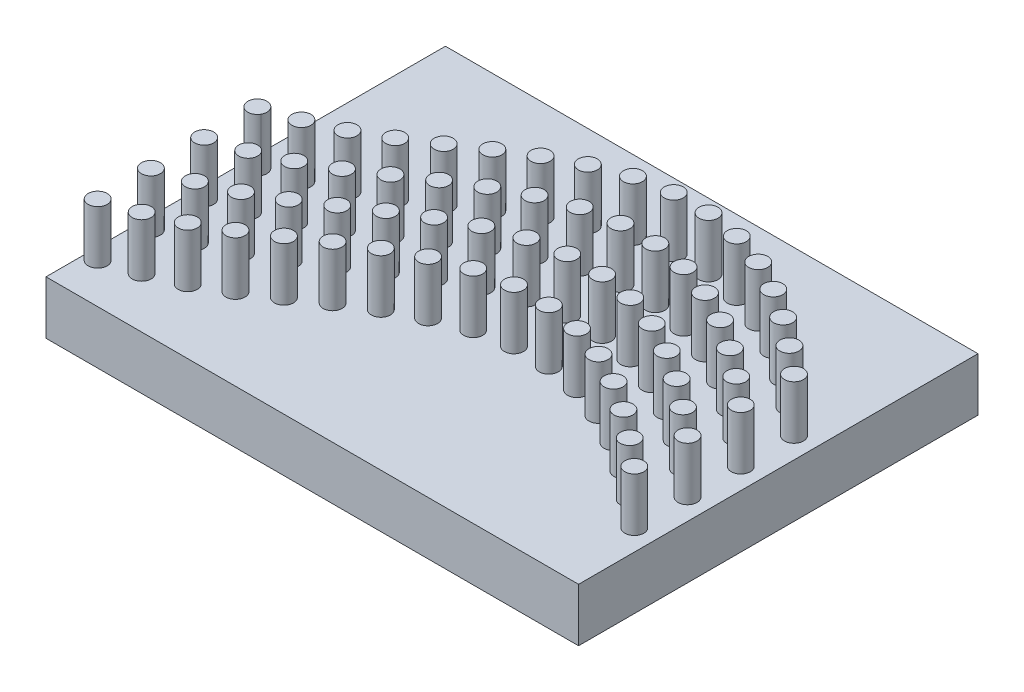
ISO-10303-21;
HEADER;
FILE_DESCRIPTION(('STEP AP214'),'2;1');
FILE_NAME('part.step','',(''),(''),'','','');
FILE_SCHEMA(('AUTOMOTIVE_DESIGN { 1 0 10303 214 1 1 1 1 }'));
ENDSEC;
DATA;
#1=APPLICATION_CONTEXT('core data for automotive mechanical design processes');
#2=APPLICATION_PROTOCOL_DEFINITION('international standard','automotive_design',2000,#1);
#3=PRODUCT_CONTEXT('',#1,'mechanical');
#4=PRODUCT('Part','Part','',(#3));
#5=PRODUCT_RELATED_PRODUCT_CATEGORY('part','',(#4));
#6=PRODUCT_DEFINITION_FORMATION('','',#4);
#7=PRODUCT_DEFINITION_CONTEXT('part definition',#1,'design');
#8=PRODUCT_DEFINITION('design','',#6,#7);
#9=PRODUCT_DEFINITION_SHAPE('','',#8);
#10=(LENGTH_UNIT() NAMED_UNIT(*) SI_UNIT(.MILLI.,.METRE.));
#11=(NAMED_UNIT(*) PLANE_ANGLE_UNIT() SI_UNIT($,.RADIAN.));
#12=(NAMED_UNIT(*) SI_UNIT($,.STERADIAN.) SOLID_ANGLE_UNIT());
#13=UNCERTAINTY_MEASURE_WITH_UNIT(LENGTH_MEASURE(1.E-05),#10,'distance_accuracy_value','');
#14=(GEOMETRIC_REPRESENTATION_CONTEXT(3) GLOBAL_UNCERTAINTY_ASSIGNED_CONTEXT((#13)) GLOBAL_UNIT_ASSIGNED_CONTEXT((#10,
#11,#12)) REPRESENTATION_CONTEXT('',''));
#15=CARTESIAN_POINT('',(0.,0.,0.));
#16=DIRECTION('',(0.,0.,1.));
#17=DIRECTION('',(1.,0.,0.));
#18=AXIS2_PLACEMENT_3D('',#15,#16,#17);
#19=CARTESIAN_POINT('',(-100.,20.,75.));
#20=DIRECTION('',(0.,1.,0.));
#21=DIRECTION('',(0.,0.,1.));
#22=AXIS2_PLACEMENT_3D('',#19,#20,#21);
#23=PLANE('',#22);
#24=CARTESIAN_POINT('',(92.0769751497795,20.,26.1545782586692));
#25=DIRECTION('',(0.,1.,0.));
#26=DIRECTION('',(0.,0.,1.));
#27=AXIS2_PLACEMENT_3D('',#24,#25,#26);
#28=CIRCLE('',#27,3.5700869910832);
#29=CARTESIAN_POINT('',(92.0769751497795,20.,29.7246652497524));
#30=VERTEX_POINT('',#29);
#31=EDGE_CURVE('E708',#30,#30,#28,.T.);
#32=ORIENTED_EDGE('',*,*,#31,.F.);
#33=EDGE_LOOP('',(#32));
#34=FACE_BOUND('',#33,.T.);
#35=CARTESIAN_POINT('',(92.0769751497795,20.,-13.8303481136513));
#36=DIRECTION('',(0.,1.,0.));
#37=DIRECTION('',(0.,0.,1.));
#38=AXIS2_PLACEMENT_3D('',#35,#36,#37);
#39=CIRCLE('',#38,3.5700869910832);
#40=CARTESIAN_POINT('',(92.0769751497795,20.,-10.2602611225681));
#41=VERTEX_POINT('',#40);
#42=EDGE_CURVE('E725',#41,#41,#39,.T.);
#43=ORIENTED_EDGE('',*,*,#42,.F.);
#44=EDGE_LOOP('',(#43));
#45=FACE_BOUND('',#44,.T.);
#46=CARTESIAN_POINT('',(81.9522150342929,20.,17.7500672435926));
#47=DIRECTION('',(0.,1.,0.));
#48=DIRECTION('',(0.,0.,1.));
#49=AXIS2_PLACEMENT_3D('',#46,#47,#48);
#50=CIRCLE('',#49,3.5700869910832);
#51=CARTESIAN_POINT('',(81.9522150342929,20.,21.3201542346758));
#52=VERTEX_POINT('',#51);
#53=EDGE_CURVE('E737',#52,#52,#50,.T.);
#54=ORIENTED_EDGE('',*,*,#53,.F.);
#55=EDGE_LOOP('',(#54));
#56=FACE_BOUND('',#55,.T.);
#57=CARTESIAN_POINT('',(81.9522150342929,20.,-22.2348591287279));
#58=DIRECTION('',(0.,1.,0.));
#59=DIRECTION('',(0.,0.,1.));
#60=AXIS2_PLACEMENT_3D('',#57,#58,#59);
#61=CIRCLE('',#60,3.5700869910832);
#62=CARTESIAN_POINT('',(81.9522150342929,20.,-18.6647721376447));
#63=VERTEX_POINT('',#62);
#64=EDGE_CURVE('E749',#63,#63,#61,.T.);
#65=ORIENTED_EDGE('',*,*,#64,.F.);
#66=EDGE_LOOP('',(#65));
#67=FACE_BOUND('',#66,.T.);
#68=CARTESIAN_POINT('',(71.5442131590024,20.,9.71340131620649));
#69=DIRECTION('',(0.,1.,0.));
#70=DIRECTION('',(0.,0.,1.));
#71=AXIS2_PLACEMENT_3D('',#68,#69,#70);
#72=CIRCLE('',#71,3.5700869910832);
#73=CARTESIAN_POINT('',(71.5442131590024,20.,13.2834883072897));
#74=VERTEX_POINT('',#73);
#75=EDGE_CURVE('E761',#74,#74,#72,.T.);
#76=ORIENTED_EDGE('',*,*,#75,.F.);
#77=EDGE_LOOP('',(#76));
#78=FACE_BOUND('',#77,.T.);
#79=CARTESIAN_POINT('',(71.5442131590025,20.,-30.2715250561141));
#80=DIRECTION('',(0.,1.,0.));
#81=DIRECTION('',(0.,0.,1.));
#82=AXIS2_PLACEMENT_3D('',#79,#80,#81);
#83=CIRCLE('',#82,3.5700869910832);
#84=CARTESIAN_POINT('',(71.5442131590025,20.,-26.7014380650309));
#85=VERTEX_POINT('',#84);
#86=EDGE_CURVE('E773',#85,#85,#83,.T.);
#87=ORIENTED_EDGE('',*,*,#86,.F.);
#88=EDGE_LOOP('',(#87));
#89=FACE_BOUND('',#88,.T.);
#90=CARTESIAN_POINT('',(60.5714510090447,20.,2.43595741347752));
#91=DIRECTION('',(0.,1.,0.));
#92=DIRECTION('',(0.,0.,1.));
#93=AXIS2_PLACEMENT_3D('',#90,#91,#92);
#94=CIRCLE('',#93,3.5700869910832);
#95=CARTESIAN_POINT('',(60.5714510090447,20.,6.00604440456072));
#96=VERTEX_POINT('',#95);
#97=EDGE_CURVE('E785',#96,#96,#94,.T.);
#98=ORIENTED_EDGE('',*,*,#97,.F.);
#99=EDGE_LOOP('',(#98));
#100=FACE_BOUND('',#99,.T.);
#101=CARTESIAN_POINT('',(60.5714510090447,20.,-37.548968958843));
#102=DIRECTION('',(0.,1.,0.));
#103=DIRECTION('',(0.,0.,1.));
#104=AXIS2_PLACEMENT_3D('',#101,#102,#103);
#105=CIRCLE('',#104,3.5700869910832);
#106=CARTESIAN_POINT('',(60.5714510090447,20.,-33.9788819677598));
#107=VERTEX_POINT('',#106);
#108=EDGE_CURVE('E797',#107,#107,#105,.T.);
#109=ORIENTED_EDGE('',*,*,#108,.F.);
#110=EDGE_LOOP('',(#109));
#111=FACE_BOUND('',#110,.T.);
#112=CARTESIAN_POINT('',(48.8839395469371,20.,-3.5989214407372));
#113=DIRECTION('',(0.,1.,0.));
#114=DIRECTION('',(0.,0.,1.));
#115=AXIS2_PLACEMENT_3D('',#112,#113,#114);
#116=CIRCLE('',#115,3.5700869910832);
#117=CARTESIAN_POINT('',(48.8839395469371,20.,-0.0288344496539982));
#118=VERTEX_POINT('',#117);
#119=EDGE_CURVE('E809',#118,#118,#116,.T.);
#120=ORIENTED_EDGE('',*,*,#119,.F.);
#121=EDGE_LOOP('',(#120));
#122=FACE_BOUND('',#121,.T.);
#123=CARTESIAN_POINT('',(48.8839395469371,20.,-43.5838478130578));
#124=DIRECTION('',(0.,1.,0.));
#125=DIRECTION('',(0.,0.,1.));
#126=AXIS2_PLACEMENT_3D('',#123,#124,#125);
#127=CIRCLE('',#126,3.5700869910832);
#128=CARTESIAN_POINT('',(48.8839395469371,20.,-40.0137608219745));
#129=VERTEX_POINT('',#128);
#130=EDGE_CURVE('E821',#129,#129,#127,.T.);
#131=ORIENTED_EDGE('',*,*,#130,.F.);
#132=EDGE_LOOP('',(#131));
#133=FACE_BOUND('',#132,.T.);
#134=CARTESIAN_POINT('',(36.4794448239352,20.,-7.94251386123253));
#135=DIRECTION('',(0.,1.,0.));
#136=DIRECTION('',(0.,0.,1.));
#137=AXIS2_PLACEMENT_3D('',#134,#135,#136);
#138=CIRCLE('',#137,3.5700869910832);
#139=CARTESIAN_POINT('',(36.4794448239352,20.,-4.37242687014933));
#140=VERTEX_POINT('',#139);
#141=EDGE_CURVE('E833',#140,#140,#138,.T.);
#142=ORIENTED_EDGE('',*,*,#141,.F.);
#143=EDGE_LOOP('',(#142));
#144=FACE_BOUND('',#143,.T.);
#145=CARTESIAN_POINT('',(36.4794448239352,20.,-47.9274402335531));
#146=DIRECTION('',(0.,1.,0.));
#147=DIRECTION('',(0.,0.,1.));
#148=AXIS2_PLACEMENT_3D('',#145,#146,#147);
#149=CIRCLE('',#148,3.5700869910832);
#150=CARTESIAN_POINT('',(36.4794448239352,20.,-44.3573532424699));
#151=VERTEX_POINT('',#150);
#152=EDGE_CURVE('E845',#151,#151,#149,.T.);
#153=ORIENTED_EDGE('',*,*,#152,.F.);
#154=EDGE_LOOP('',(#153));
#155=FACE_BOUND('',#154,.T.);
#156=CARTESIAN_POINT('',(23.5528347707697,20.,-10.2782554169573));
#157=DIRECTION('',(0.,1.,0.));
#158=DIRECTION('',(0.,0.,1.));
#159=AXIS2_PLACEMENT_3D('',#156,#157,#158);
#160=CIRCLE('',#159,3.5700869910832);
#161=CARTESIAN_POINT('',(23.5528347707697,20.,-6.70816842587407));
#162=VERTEX_POINT('',#161);
#163=EDGE_CURVE('E857',#162,#162,#160,.T.);
#164=ORIENTED_EDGE('',*,*,#163,.F.);
#165=EDGE_LOOP('',(#164));
#166=FACE_BOUND('',#165,.T.);
#167=CARTESIAN_POINT('',(23.5528347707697,20.,-50.2631817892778));
#168=DIRECTION('',(0.,1.,0.));
#169=DIRECTION('',(0.,0.,1.));
#170=AXIS2_PLACEMENT_3D('',#167,#168,#169);
#171=CIRCLE('',#170,3.5700869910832);
#172=CARTESIAN_POINT('',(23.5528347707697,20.,-46.6930947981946));
#173=VERTEX_POINT('',#172);
#174=EDGE_CURVE('E869',#173,#173,#171,.T.);
#175=ORIENTED_EDGE('',*,*,#174,.F.);
#176=EDGE_LOOP('',(#175));
#177=FACE_BOUND('',#176,.T.);
#178=CARTESIAN_POINT('',(10.4080173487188,20.,-10.3359148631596));
#179=DIRECTION('',(0.,1.,0.));
#180=DIRECTION('',(0.,0.,1.));
#181=AXIS2_PLACEMENT_3D('',#178,#179,#180);
#182=CIRCLE('',#181,3.5700869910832);
#183=CARTESIAN_POINT('',(10.4080173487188,20.,-6.76582787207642));
#184=VERTEX_POINT('',#183);
#185=EDGE_CURVE('E881',#184,#184,#182,.T.);
#186=ORIENTED_EDGE('',*,*,#185,.F.);
#187=EDGE_LOOP('',(#186));
#188=FACE_BOUND('',#187,.T.);
#189=CARTESIAN_POINT('',(10.4080173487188,20.,-50.3208412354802));
#190=DIRECTION('',(0.,1.,0.));
#191=DIRECTION('',(0.,0.,1.));
#192=AXIS2_PLACEMENT_3D('',#189,#190,#191);
#193=CIRCLE('',#192,3.5700869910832);
#194=CARTESIAN_POINT('',(10.4080173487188,20.,-46.750754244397));
#195=VERTEX_POINT('',#194);
#196=EDGE_CURVE('E893',#195,#195,#193,.T.);
#197=ORIENTED_EDGE('',*,*,#196,.F.);
#198=EDGE_LOOP('',(#197));
#199=FACE_BOUND('',#198,.T.);
#200=CARTESIAN_POINT('',(-2.52843780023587,20.,-7.9566173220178));
#201=DIRECTION('',(0.,1.,0.));
#202=DIRECTION('',(0.,0.,1.));
#203=AXIS2_PLACEMENT_3D('',#200,#201,#202);
#204=CIRCLE('',#203,3.5700869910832);
#205=CARTESIAN_POINT('',(-2.52843780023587,20.,-4.3865303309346));
#206=VERTEX_POINT('',#205);
#207=EDGE_CURVE('E905',#206,#206,#204,.T.);
#208=ORIENTED_EDGE('',*,*,#207,.F.);
#209=EDGE_LOOP('',(#208));
#210=FACE_BOUND('',#209,.T.);
#211=CARTESIAN_POINT('',(-2.52843780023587,20.,-47.9415436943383));
#212=DIRECTION('',(0.,1.,0.));
#213=DIRECTION('',(0.,0.,1.));
#214=AXIS2_PLACEMENT_3D('',#211,#212,#213);
#215=CIRCLE('',#214,3.5700869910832);
#216=CARTESIAN_POINT('',(-2.52843780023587,20.,-44.3714567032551));
#217=VERTEX_POINT('',#216);
#218=EDGE_CURVE('E917',#217,#217,#215,.T.);
#219=ORIENTED_EDGE('',*,*,#218,.F.);
#220=EDGE_LOOP('',(#219));
#221=FACE_BOUND('',#220,.T.);
#222=CARTESIAN_POINT('',(-14.8327005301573,20.,-3.32471441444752));
#223=DIRECTION('',(0.,1.,0.));
#224=DIRECTION('',(0.,0.,1.));
#225=AXIS2_PLACEMENT_3D('',#222,#223,#224);
#226=CIRCLE('',#225,3.5700869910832);
#227=CARTESIAN_POINT('',(-14.8327005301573,20.,0.245372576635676));
#228=VERTEX_POINT('',#227);
#229=EDGE_CURVE('E929',#228,#228,#226,.T.);
#230=ORIENTED_EDGE('',*,*,#229,.F.);
#231=EDGE_LOOP('',(#230));
#232=FACE_BOUND('',#231,.T.);
#233=CARTESIAN_POINT('',(-14.8327005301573,20.,-43.3096407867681));
#234=DIRECTION('',(0.,1.,0.));
#235=DIRECTION('',(0.,0.,1.));
#236=AXIS2_PLACEMENT_3D('',#233,#234,#235);
#237=CIRCLE('',#236,3.5700869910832);
#238=CARTESIAN_POINT('',(-14.8327005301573,20.,-39.7395537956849));
#239=VERTEX_POINT('',#238);
#240=EDGE_CURVE('E941',#239,#239,#237,.T.);
#241=ORIENTED_EDGE('',*,*,#240,.F.);
#242=EDGE_LOOP('',(#241));
#243=FACE_BOUND('',#242,.T.);
#244=CARTESIAN_POINT('',(-26.4843200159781,20.,2.77560580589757));
#245=DIRECTION('',(0.,1.,0.));
#246=DIRECTION('',(0.,0.,1.));
#247=AXIS2_PLACEMENT_3D('',#244,#245,#246);
#248=CIRCLE('',#247,3.5700869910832);
#249=CARTESIAN_POINT('',(-26.4843200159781,20.,6.34569279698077));
#250=VERTEX_POINT('',#249);
#251=EDGE_CURVE('E953',#250,#250,#248,.T.);
#252=ORIENTED_EDGE('',*,*,#251,.F.);
#253=EDGE_LOOP('',(#252));
#254=FACE_BOUND('',#253,.T.);
#255=CARTESIAN_POINT('',(-26.4843200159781,20.,-37.209320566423));
#256=DIRECTION('',(0.,1.,0.));
#257=DIRECTION('',(0.,0.,1.));
#258=AXIS2_PLACEMENT_3D('',#255,#256,#257);
#259=CIRCLE('',#258,3.5700869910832);
#260=CARTESIAN_POINT('',(-26.4843200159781,20.,-33.6392335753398));
#261=VERTEX_POINT('',#260);
#262=EDGE_CURVE('E965',#261,#261,#259,.T.);
#263=ORIENTED_EDGE('',*,*,#262,.F.);
#264=EDGE_LOOP('',(#263));
#265=FACE_BOUND('',#264,.T.);
#266=CARTESIAN_POINT('',(-37.663808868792,20.,9.70086249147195));
#267=DIRECTION('',(0.,1.,0.));
#268=DIRECTION('',(0.,0.,1.));
#269=AXIS2_PLACEMENT_3D('',#266,#267,#268);
#270=CIRCLE('',#269,3.5700869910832);
#271=CARTESIAN_POINT('',(-37.663808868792,20.,13.2709494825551));
#272=VERTEX_POINT('',#271);
#273=EDGE_CURVE('E977',#272,#272,#270,.T.);
#274=ORIENTED_EDGE('',*,*,#273,.F.);
#275=EDGE_LOOP('',(#274));
#276=FACE_BOUND('',#275,.T.);
#277=CARTESIAN_POINT('',(-37.663808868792,20.,-30.2840638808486));
#278=DIRECTION('',(0.,1.,0.));
#279=DIRECTION('',(0.,0.,1.));
#280=AXIS2_PLACEMENT_3D('',#277,#278,#279);
#281=CIRCLE('',#280,3.5700869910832);
#282=CARTESIAN_POINT('',(-37.663808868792,20.,-26.7139768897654));
#283=VERTEX_POINT('',#282);
#284=EDGE_CURVE('E989',#283,#283,#281,.T.);
#285=ORIENTED_EDGE('',*,*,#284,.F.);
#286=EDGE_LOOP('',(#285));
#287=FACE_BOUND('',#286,.T.);
#288=CARTESIAN_POINT('',(-48.6140973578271,20.,17.0206232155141));
#289=DIRECTION('',(0.,1.,0.));
#290=DIRECTION('',(0.,0.,1.));
#291=AXIS2_PLACEMENT_3D('',#288,#289,#290);
#292=CIRCLE('',#291,3.5700869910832);
#293=CARTESIAN_POINT('',(-48.6140973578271,20.,20.5907102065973));
#294=VERTEX_POINT('',#293);
#295=EDGE_CURVE('E1001',#294,#294,#292,.T.);
#296=ORIENTED_EDGE('',*,*,#295,.F.);
#297=EDGE_LOOP('',(#296));
#298=FACE_BOUND('',#297,.T.);
#299=CARTESIAN_POINT('',(-48.6140973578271,20.,-22.9643031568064));
#300=DIRECTION('',(0.,1.,0.));
#301=DIRECTION('',(0.,0.,1.));
#302=AXIS2_PLACEMENT_3D('',#299,#300,#301);
#303=CIRCLE('',#302,3.5700869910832);
#304=CARTESIAN_POINT('',(-48.6140973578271,20.,-19.3942161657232));
#305=VERTEX_POINT('',#304);
#306=EDGE_CURVE('E1013',#305,#305,#303,.T.);
#307=ORIENTED_EDGE('',*,*,#306,.F.);
#308=EDGE_LOOP('',(#307));
#309=FACE_BOUND('',#308,.T.);
#310=CARTESIAN_POINT('',(-59.6046740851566,20.,24.2449380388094));
#311=DIRECTION('',(0.,1.,0.));
#312=DIRECTION('',(0.,0.,1.));
#313=AXIS2_PLACEMENT_3D('',#310,#311,#312);
#314=CIRCLE('',#313,3.5700869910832);
#315=CARTESIAN_POINT('',(-59.6046740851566,20.,27.8150250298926));
#316=VERTEX_POINT('',#315);
#317=EDGE_CURVE('E1025',#316,#316,#314,.T.);
#318=ORIENTED_EDGE('',*,*,#317,.F.);
#319=EDGE_LOOP('',(#318));
#320=FACE_BOUND('',#319,.T.);
#321=CARTESIAN_POINT('',(-59.6046740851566,20.,-15.7399883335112));
#322=DIRECTION('',(0.,1.,0.));
#323=DIRECTION('',(0.,0.,1.));
#324=AXIS2_PLACEMENT_3D('',#321,#322,#323);
#325=CIRCLE('',#324,3.5700869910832);
#326=CARTESIAN_POINT('',(-59.6046740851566,20.,-12.169901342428));
#327=VERTEX_POINT('',#326);
#328=EDGE_CURVE('E1037',#327,#327,#325,.T.);
#329=ORIENTED_EDGE('',*,*,#328,.F.);
#330=EDGE_LOOP('',(#329));
#331=FACE_BOUND('',#330,.T.);
#332=CARTESIAN_POINT('',(-71.0602631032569,20.,30.7198818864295));
#333=DIRECTION('',(0.,1.,0.));
#334=DIRECTION('',(0.,0.,1.));
#335=AXIS2_PLACEMENT_3D('',#332,#333,#334);
#336=CIRCLE('',#335,3.5700869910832);
#337=CARTESIAN_POINT('',(-71.0602631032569,20.,34.2899688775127));
#338=VERTEX_POINT('',#337);
#339=EDGE_CURVE('E1049',#338,#338,#336,.T.);
#340=ORIENTED_EDGE('',*,*,#339,.F.);
#341=EDGE_LOOP('',(#340));
#342=FACE_BOUND('',#341,.T.);
#343=CARTESIAN_POINT('',(-71.0602631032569,20.,-9.26504448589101));
#344=DIRECTION('',(0.,1.,0.));
#345=DIRECTION('',(0.,0.,1.));
#346=AXIS2_PLACEMENT_3D('',#343,#344,#345);
#347=CIRCLE('',#346,3.5700869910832);
#348=CARTESIAN_POINT('',(-71.0602631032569,20.,-5.69495749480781));
#349=VERTEX_POINT('',#348);
#350=EDGE_CURVE('E1061',#349,#349,#347,.T.);
#351=ORIENTED_EDGE('',*,*,#350,.F.);
#352=EDGE_LOOP('',(#351));
#353=FACE_BOUND('',#352,.T.);
#354=CARTESIAN_POINT('',(-83.1151653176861,20.,35.9607262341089));
#355=DIRECTION('',(0.,1.,0.));
#356=DIRECTION('',(0.,0.,1.));
#357=AXIS2_PLACEMENT_3D('',#354,#355,#356);
#358=CIRCLE('',#357,3.5700869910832);
#359=CARTESIAN_POINT('',(-83.1151653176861,20.,39.5308132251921));
#360=VERTEX_POINT('',#359);
#361=EDGE_CURVE('E1073',#360,#360,#358,.T.);
#362=ORIENTED_EDGE('',*,*,#361,.F.);
#363=EDGE_LOOP('',(#362));
#364=FACE_BOUND('',#363,.T.);
#365=CARTESIAN_POINT('',(-83.1151653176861,20.,-4.02420013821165));
#366=DIRECTION('',(0.,1.,0.));
#367=DIRECTION('',(0.,0.,1.));
#368=AXIS2_PLACEMENT_3D('',#365,#366,#367);
#369=CIRCLE('',#368,3.5700869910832);
#370=CARTESIAN_POINT('',(-83.1151653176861,20.,-0.454113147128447));
#371=VERTEX_POINT('',#370);
#372=EDGE_CURVE('E1085',#371,#371,#369,.T.);
#373=ORIENTED_EDGE('',*,*,#372,.F.);
#374=EDGE_LOOP('',(#373));
#375=FACE_BOUND('',#374,.T.);
#376=CARTESIAN_POINT('',(-95.6371406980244,20.,39.9686515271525));
#377=DIRECTION('',(0.,1.,0.));
#378=DIRECTION('',(0.,0.,1.));
#379=AXIS2_PLACEMENT_3D('',#376,#377,#378);
#380=CIRCLE('',#379,3.5700869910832);
#381=CARTESIAN_POINT('',(-95.6371406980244,20.,43.5387385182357));
#382=VERTEX_POINT('',#381);
#383=EDGE_CURVE('E1097',#382,#382,#380,.T.);
#384=ORIENTED_EDGE('',*,*,#383,.F.);
#385=EDGE_LOOP('',(#384));
#386=FACE_BOUND('',#385,.T.);
#387=CARTESIAN_POINT('',(-95.6420786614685,20.,-0.00721704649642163));
#388=DIRECTION('',(0.,1.,0.));
#389=DIRECTION('',(0.,0.,1.));
#390=AXIS2_PLACEMENT_3D('',#387,#388,#389);
#391=CIRCLE('',#390,3.5700869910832);
#392=CARTESIAN_POINT('',(-98.774155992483,20.,-1.72058003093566));
#393=VERTEX_POINT('',#392);
#394=CARTESIAN_POINT('',(-92.5050633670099,20.,1.69708813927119));
#395=VERTEX_POINT('',#394);
#396=EDGE_CURVE('E92',#393,#395,#391,.T.);
#397=ORIENTED_EDGE('',*,*,#396,.F.);
#398=CARTESIAN_POINT('',(-95.6371406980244,20.,-0.0162748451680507));
#399=DIRECTION('',(0.,1.,0.));
#400=DIRECTION('',(0.,0.,1.));
#401=AXIS2_PLACEMENT_3D('',#398,#399,#400);
#402=CIRCLE('',#401,3.5700869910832);
#403=EDGE_CURVE('E85',#395,#393,#402,.T.);
#404=ORIENTED_EDGE('',*,*,#403,.F.);
#405=EDGE_LOOP('',(#397,#404));
#406=FACE_BOUND('',#405,.T.);
#407=DIRECTION('',(0.,0.,1.));
#408=VECTOR('',#407,1.);
#409=CARTESIAN_POINT('',(-100.,20.,-75.));
#410=LINE('',#409,#408);
#411=CARTESIAN_POINT('',(-100.,20.,-75.));
#412=VERTEX_POINT('',#411);
#413=CARTESIAN_POINT('',(-100.,20.,75.));
#414=VERTEX_POINT('',#413);
#415=EDGE_CURVE('E107',#412,#414,#410,.T.);
#416=ORIENTED_EDGE('',*,*,#415,.T.);
#417=DIRECTION('',(1.,0.,0.));
#418=VECTOR('',#417,1.);
#419=CARTESIAN_POINT('',(-100.,20.,75.));
#420=LINE('',#419,#418);
#421=CARTESIAN_POINT('',(100.,20.,75.));
#422=VERTEX_POINT('',#421);
#423=EDGE_CURVE('E109',#414,#422,#420,.T.);
#424=ORIENTED_EDGE('',*,*,#423,.T.);
#425=DIRECTION('',(0.,0.,-1.));
#426=VECTOR('',#425,1.);
#427=CARTESIAN_POINT('',(100.,20.,-75.));
#428=LINE('',#427,#426);
#429=CARTESIAN_POINT('',(100.,20.,-75.));
#430=VERTEX_POINT('',#429);
#431=EDGE_CURVE('E111',#422,#430,#428,.T.);
#432=ORIENTED_EDGE('',*,*,#431,.T.);
#433=DIRECTION('',(-1.,0.,0.));
#434=VECTOR('',#433,1.);
#435=CARTESIAN_POINT('',(-100.,20.,-75.));
#436=LINE('',#435,#434);
#437=EDGE_CURVE('E48',#430,#412,#436,.T.);
#438=ORIENTED_EDGE('',*,*,#437,.T.);
#439=EDGE_LOOP('',(#416,#424,#432,#438));
#440=FACE_BOUND('',#439,.T.);
#441=CARTESIAN_POINT('',(-95.6371406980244,20.,19.9716102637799));
#442=DIRECTION('',(0.,1.,0.));
#443=DIRECTION('',(0.,0.,1.));
#444=AXIS2_PLACEMENT_3D('',#441,#442,#443);
#445=CIRCLE('',#444,3.5700869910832);
#446=CARTESIAN_POINT('',(-95.6371406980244,20.,23.5416972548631));
#447=VERTEX_POINT('',#446);
#448=EDGE_CURVE('E1103',#447,#447,#445,.T.);
#449=ORIENTED_EDGE('',*,*,#448,.F.);
#450=EDGE_LOOP('',(#449));
#451=FACE_BOUND('',#450,.T.);
#452=CARTESIAN_POINT('',(-95.6371406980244,20.,59.9656927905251));
#453=DIRECTION('',(0.,1.,0.));
#454=DIRECTION('',(0.,0.,1.));
#455=AXIS2_PLACEMENT_3D('',#452,#453,#454);
#456=CIRCLE('',#455,3.5700869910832);
#457=CARTESIAN_POINT('',(-95.6371406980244,20.,63.5357797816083));
#458=VERTEX_POINT('',#457);
#459=EDGE_CURVE('E1091',#458,#458,#456,.T.);
#460=ORIENTED_EDGE('',*,*,#459,.F.);
#461=EDGE_LOOP('',(#460));
#462=FACE_BOUND('',#461,.T.);
#463=CARTESIAN_POINT('',(-83.1151653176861,20.,15.9636849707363));
#464=DIRECTION('',(0.,1.,0.));
#465=DIRECTION('',(0.,0.,1.));
#466=AXIS2_PLACEMENT_3D('',#463,#464,#465);
#467=CIRCLE('',#466,3.5700869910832);
#468=CARTESIAN_POINT('',(-83.1151653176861,20.,19.5337719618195));
#469=VERTEX_POINT('',#468);
#470=EDGE_CURVE('E1079',#469,#469,#467,.T.);
#471=ORIENTED_EDGE('',*,*,#470,.F.);
#472=EDGE_LOOP('',(#471));
#473=FACE_BOUND('',#472,.T.);
#474=CARTESIAN_POINT('',(-83.1151653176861,20.,55.9577674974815));
#475=DIRECTION('',(0.,1.,0.));
#476=DIRECTION('',(0.,0.,1.));
#477=AXIS2_PLACEMENT_3D('',#474,#475,#476);
#478=CIRCLE('',#477,3.5700869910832);
#479=CARTESIAN_POINT('',(-83.1151653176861,20.,59.5278544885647));
#480=VERTEX_POINT('',#479);
#481=EDGE_CURVE('E1067',#480,#480,#478,.T.);
#482=ORIENTED_EDGE('',*,*,#481,.F.);
#483=EDGE_LOOP('',(#482));
#484=FACE_BOUND('',#483,.T.);
#485=CARTESIAN_POINT('',(-71.0602631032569,20.,10.722840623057));
#486=DIRECTION('',(0.,1.,0.));
#487=DIRECTION('',(0.,0.,1.));
#488=AXIS2_PLACEMENT_3D('',#485,#486,#487);
#489=CIRCLE('',#488,3.5700869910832);
#490=CARTESIAN_POINT('',(-71.0602631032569,20.,14.2929276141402));
#491=VERTEX_POINT('',#490);
#492=EDGE_CURVE('E1055',#491,#491,#489,.T.);
#493=ORIENTED_EDGE('',*,*,#492,.F.);
#494=EDGE_LOOP('',(#493));
#495=FACE_BOUND('',#494,.T.);
#496=CARTESIAN_POINT('',(-71.0602631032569,20.,50.7169231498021));
#497=DIRECTION('',(0.,1.,0.));
#498=DIRECTION('',(0.,0.,1.));
#499=AXIS2_PLACEMENT_3D('',#496,#497,#498);
#500=CIRCLE('',#499,3.5700869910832);
#501=CARTESIAN_POINT('',(-71.0602631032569,20.,54.2870101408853));
#502=VERTEX_POINT('',#501);
#503=EDGE_CURVE('E1043',#502,#502,#500,.T.);
#504=ORIENTED_EDGE('',*,*,#503,.F.);
#505=EDGE_LOOP('',(#504));
#506=FACE_BOUND('',#505,.T.);
#507=CARTESIAN_POINT('',(-59.6046740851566,20.,4.2478967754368));
#508=DIRECTION('',(0.,1.,0.));
#509=DIRECTION('',(0.,0.,1.));
#510=AXIS2_PLACEMENT_3D('',#507,#508,#509);
#511=CIRCLE('',#510,3.5700869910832);
#512=CARTESIAN_POINT('',(-59.6046740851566,20.,7.81798376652));
#513=VERTEX_POINT('',#512);
#514=EDGE_CURVE('E1031',#513,#513,#511,.T.);
#515=ORIENTED_EDGE('',*,*,#514,.F.);
#516=EDGE_LOOP('',(#515));
#517=FACE_BOUND('',#516,.T.);
#518=CARTESIAN_POINT('',(-59.6046740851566,20.,44.241979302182));
#519=DIRECTION('',(0.,1.,0.));
#520=DIRECTION('',(0.,0.,1.));
#521=AXIS2_PLACEMENT_3D('',#518,#519,#520);
#522=CIRCLE('',#521,3.5700869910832);
#523=CARTESIAN_POINT('',(-59.6046740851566,20.,47.8120662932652));
#524=VERTEX_POINT('',#523);
#525=EDGE_CURVE('E1019',#524,#524,#522,.T.);
#526=ORIENTED_EDGE('',*,*,#525,.F.);
#527=EDGE_LOOP('',(#526));
#528=FACE_BOUND('',#527,.T.);
#529=CARTESIAN_POINT('',(-48.6140973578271,20.,-2.97641804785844));
#530=DIRECTION('',(0.,1.,0.));
#531=DIRECTION('',(0.,0.,1.));
#532=AXIS2_PLACEMENT_3D('',#529,#530,#531);
#533=CIRCLE('',#532,3.5700869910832);
#534=CARTESIAN_POINT('',(-48.6140973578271,20.,0.593668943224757));
#535=VERTEX_POINT('',#534);
#536=EDGE_CURVE('E1007',#535,#535,#533,.T.);
#537=ORIENTED_EDGE('',*,*,#536,.F.);
#538=EDGE_LOOP('',(#537));
#539=FACE_BOUND('',#538,.T.);
#540=CARTESIAN_POINT('',(-48.6140973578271,20.,37.0176644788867));
#541=DIRECTION('',(0.,1.,0.));
#542=DIRECTION('',(0.,0.,1.));
#543=AXIS2_PLACEMENT_3D('',#540,#541,#542);
#544=CIRCLE('',#543,3.5700869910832);
#545=CARTESIAN_POINT('',(-48.6140973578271,20.,40.5877514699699));
#546=VERTEX_POINT('',#545);
#547=EDGE_CURVE('E995',#546,#546,#544,.T.);
#548=ORIENTED_EDGE('',*,*,#547,.F.);
#549=EDGE_LOOP('',(#548));
#550=FACE_BOUND('',#549,.T.);
#551=CARTESIAN_POINT('',(-37.663808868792,20.,-10.2961787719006));
#552=DIRECTION('',(0.,1.,0.));
#553=DIRECTION('',(0.,0.,1.));
#554=AXIS2_PLACEMENT_3D('',#551,#552,#553);
#555=CIRCLE('',#554,3.5700869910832);
#556=CARTESIAN_POINT('',(-37.663808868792,20.,-6.72609178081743));
#557=VERTEX_POINT('',#556);
#558=EDGE_CURVE('E983',#557,#557,#555,.T.);
#559=ORIENTED_EDGE('',*,*,#558,.F.);
#560=EDGE_LOOP('',(#559));
#561=FACE_BOUND('',#560,.T.);
#562=CARTESIAN_POINT('',(-37.663808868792,20.,29.6979037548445));
#563=DIRECTION('',(0.,1.,0.));
#564=DIRECTION('',(0.,0.,1.));
#565=AXIS2_PLACEMENT_3D('',#562,#563,#564);
#566=CIRCLE('',#565,3.5700869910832);
#567=CARTESIAN_POINT('',(-37.663808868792,20.,33.2679907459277));
#568=VERTEX_POINT('',#567);
#569=EDGE_CURVE('E971',#568,#568,#566,.T.);
#570=ORIENTED_EDGE('',*,*,#569,.F.);
#571=EDGE_LOOP('',(#570));
#572=FACE_BOUND('',#571,.T.);
#573=CARTESIAN_POINT('',(-26.4843200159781,20.,-17.221435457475));
#574=DIRECTION('',(0.,1.,0.));
#575=DIRECTION('',(0.,0.,1.));
#576=AXIS2_PLACEMENT_3D('',#573,#574,#575);
#577=CIRCLE('',#576,3.5700869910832);
#578=CARTESIAN_POINT('',(-26.4843200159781,20.,-13.6513484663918));
#579=VERTEX_POINT('',#578);
#580=EDGE_CURVE('E959',#579,#579,#577,.T.);
#581=ORIENTED_EDGE('',*,*,#580,.F.);
#582=EDGE_LOOP('',(#581));
#583=FACE_BOUND('',#582,.T.);
#584=CARTESIAN_POINT('',(-26.4843200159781,20.,22.7726470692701));
#585=DIRECTION('',(0.,1.,0.));
#586=DIRECTION('',(0.,0.,1.));
#587=AXIS2_PLACEMENT_3D('',#584,#585,#586);
#588=CIRCLE('',#587,3.5700869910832);
#589=CARTESIAN_POINT('',(-26.4843200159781,20.,26.3427340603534));
#590=VERTEX_POINT('',#589);
#591=EDGE_CURVE('E947',#590,#590,#588,.T.);
#592=ORIENTED_EDGE('',*,*,#591,.F.);
#593=EDGE_LOOP('',(#592));
#594=FACE_BOUND('',#593,.T.);
#595=CARTESIAN_POINT('',(-14.8327005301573,20.,-23.3217556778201));
#596=DIRECTION('',(0.,1.,0.));
#597=DIRECTION('',(0.,0.,1.));
#598=AXIS2_PLACEMENT_3D('',#595,#596,#597);
#599=CIRCLE('',#598,3.5700869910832);
#600=CARTESIAN_POINT('',(-14.8327005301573,20.,-19.7516686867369));
#601=VERTEX_POINT('',#600);
#602=EDGE_CURVE('E935',#601,#601,#599,.T.);
#603=ORIENTED_EDGE('',*,*,#602,.F.);
#604=EDGE_LOOP('',(#603));
#605=FACE_BOUND('',#604,.T.);
#606=CARTESIAN_POINT('',(-14.8327005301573,20.,16.6723268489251));
#607=DIRECTION('',(0.,1.,0.));
#608=DIRECTION('',(0.,0.,1.));
#609=AXIS2_PLACEMENT_3D('',#606,#607,#608);
#610=CIRCLE('',#609,3.5700869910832);
#611=CARTESIAN_POINT('',(-14.8327005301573,20.,20.2424138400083));
#612=VERTEX_POINT('',#611);
#613=EDGE_CURVE('E923',#612,#612,#610,.T.);
#614=ORIENTED_EDGE('',*,*,#613,.F.);
#615=EDGE_LOOP('',(#614));
#616=FACE_BOUND('',#615,.T.);
#617=CARTESIAN_POINT('',(-2.52843780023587,20.,-27.9536585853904));
#618=DIRECTION('',(0.,1.,0.));
#619=DIRECTION('',(0.,0.,1.));
#620=AXIS2_PLACEMENT_3D('',#617,#618,#619);
#621=CIRCLE('',#620,3.5700869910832);
#622=CARTESIAN_POINT('',(-2.52843780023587,20.,-24.3835715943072));
#623=VERTEX_POINT('',#622);
#624=EDGE_CURVE('E911',#623,#623,#621,.T.);
#625=ORIENTED_EDGE('',*,*,#624,.F.);
#626=EDGE_LOOP('',(#625));
#627=FACE_BOUND('',#626,.T.);
#628=CARTESIAN_POINT('',(-2.52843780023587,20.,12.0404239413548));
#629=DIRECTION('',(0.,1.,0.));
#630=DIRECTION('',(0.,0.,1.));
#631=AXIS2_PLACEMENT_3D('',#628,#629,#630);
#632=CIRCLE('',#631,3.5700869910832);
#633=CARTESIAN_POINT('',(-2.52843780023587,20.,15.610510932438));
#634=VERTEX_POINT('',#633);
#635=EDGE_CURVE('E899',#634,#634,#632,.T.);
#636=ORIENTED_EDGE('',*,*,#635,.F.);
#637=EDGE_LOOP('',(#636));
#638=FACE_BOUND('',#637,.T.);
#639=CARTESIAN_POINT('',(10.4080173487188,20.,-30.3329561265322));
#640=DIRECTION('',(0.,1.,0.));
#641=DIRECTION('',(0.,0.,1.));
#642=AXIS2_PLACEMENT_3D('',#639,#640,#641);
#643=CIRCLE('',#642,3.5700869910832);
#644=CARTESIAN_POINT('',(10.4080173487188,20.,-26.762869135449));
#645=VERTEX_POINT('',#644);
#646=EDGE_CURVE('E887',#645,#645,#643,.T.);
#647=ORIENTED_EDGE('',*,*,#646,.F.);
#648=EDGE_LOOP('',(#647));
#649=FACE_BOUND('',#648,.T.);
#650=CARTESIAN_POINT('',(10.4080173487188,20.,9.66112640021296));
#651=DIRECTION('',(0.,1.,0.));
#652=DIRECTION('',(0.,0.,1.));
#653=AXIS2_PLACEMENT_3D('',#650,#651,#652);
#654=CIRCLE('',#653,3.5700869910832);
#655=CARTESIAN_POINT('',(10.4080173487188,20.,13.2312133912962));
#656=VERTEX_POINT('',#655);
#657=EDGE_CURVE('E875',#656,#656,#654,.T.);
#658=ORIENTED_EDGE('',*,*,#657,.F.);
#659=EDGE_LOOP('',(#658));
#660=FACE_BOUND('',#659,.T.);
#661=CARTESIAN_POINT('',(23.5528347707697,20.,-30.2752966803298));
#662=DIRECTION('',(0.,1.,0.));
#663=DIRECTION('',(0.,0.,1.));
#664=AXIS2_PLACEMENT_3D('',#661,#662,#663);
#665=CIRCLE('',#664,3.5700869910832);
#666=CARTESIAN_POINT('',(23.5528347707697,20.,-26.7052096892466));
#667=VERTEX_POINT('',#666);
#668=EDGE_CURVE('E863',#667,#667,#665,.T.);
#669=ORIENTED_EDGE('',*,*,#668,.F.);
#670=EDGE_LOOP('',(#669));
#671=FACE_BOUND('',#670,.T.);
#672=CARTESIAN_POINT('',(23.5528347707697,20.,9.71878584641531));
#673=DIRECTION('',(0.,1.,0.));
#674=DIRECTION('',(0.,0.,1.));
#675=AXIS2_PLACEMENT_3D('',#672,#673,#674);
#676=CIRCLE('',#675,3.5700869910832);
#677=CARTESIAN_POINT('',(23.5528347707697,20.,13.2888728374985));
#678=VERTEX_POINT('',#677);
#679=EDGE_CURVE('E851',#678,#678,#676,.T.);
#680=ORIENTED_EDGE('',*,*,#679,.F.);
#681=EDGE_LOOP('',(#680));
#682=FACE_BOUND('',#681,.T.);
#683=CARTESIAN_POINT('',(36.4794448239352,20.,-27.9395551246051));
#684=DIRECTION('',(0.,1.,0.));
#685=DIRECTION('',(0.,0.,1.));
#686=AXIS2_PLACEMENT_3D('',#683,#684,#685);
#687=CIRCLE('',#686,3.5700869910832);
#688=CARTESIAN_POINT('',(36.4794448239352,20.,-24.3694681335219));
#689=VERTEX_POINT('',#688);
#690=EDGE_CURVE('E839',#689,#689,#687,.T.);
#691=ORIENTED_EDGE('',*,*,#690,.F.);
#692=EDGE_LOOP('',(#691));
#693=FACE_BOUND('',#692,.T.);
#694=CARTESIAN_POINT('',(36.4794448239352,20.,12.05452740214));
#695=DIRECTION('',(0.,1.,0.));
#696=DIRECTION('',(0.,0.,1.));
#697=AXIS2_PLACEMENT_3D('',#694,#695,#696);
#698=CIRCLE('',#697,3.5700869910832);
#699=CARTESIAN_POINT('',(36.4794448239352,20.,15.6246143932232));
#700=VERTEX_POINT('',#699);
#701=EDGE_CURVE('E827',#700,#700,#698,.T.);
#702=ORIENTED_EDGE('',*,*,#701,.F.);
#703=EDGE_LOOP('',(#702));
#704=FACE_BOUND('',#703,.T.);
#705=CARTESIAN_POINT('',(48.8839395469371,20.,-23.5959627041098));
#706=DIRECTION('',(0.,1.,0.));
#707=DIRECTION('',(0.,0.,1.));
#708=AXIS2_PLACEMENT_3D('',#705,#706,#707);
#709=CIRCLE('',#708,3.5700869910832);
#710=CARTESIAN_POINT('',(48.8839395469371,20.,-20.0258757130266));
#711=VERTEX_POINT('',#710);
#712=EDGE_CURVE('E815',#711,#711,#709,.T.);
#713=ORIENTED_EDGE('',*,*,#712,.F.);
#714=EDGE_LOOP('',(#713));
#715=FACE_BOUND('',#714,.T.);
#716=CARTESIAN_POINT('',(48.8839395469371,20.,16.3981198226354));
#717=DIRECTION('',(0.,1.,0.));
#718=DIRECTION('',(0.,0.,1.));
#719=AXIS2_PLACEMENT_3D('',#716,#717,#718);
#720=CIRCLE('',#719,3.5700869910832);
#721=CARTESIAN_POINT('',(48.8839395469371,20.,19.9682068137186));
#722=VERTEX_POINT('',#721);
#723=EDGE_CURVE('E803',#722,#722,#720,.T.);
#724=ORIENTED_EDGE('',*,*,#723,.F.);
#725=EDGE_LOOP('',(#724));
#726=FACE_BOUND('',#725,.T.);
#727=CARTESIAN_POINT('',(60.5714510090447,20.,-17.5610838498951));
#728=DIRECTION('',(0.,1.,0.));
#729=DIRECTION('',(0.,0.,1.));
#730=AXIS2_PLACEMENT_3D('',#727,#728,#729);
#731=CIRCLE('',#730,3.5700869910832);
#732=CARTESIAN_POINT('',(60.5714510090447,20.,-13.9909968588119));
#733=VERTEX_POINT('',#732);
#734=EDGE_CURVE('E791',#733,#733,#731,.T.);
#735=ORIENTED_EDGE('',*,*,#734,.F.);
#736=EDGE_LOOP('',(#735));
#737=FACE_BOUND('',#736,.T.);
#738=CARTESIAN_POINT('',(60.5714510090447,20.,22.4329986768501));
#739=DIRECTION('',(0.,1.,0.));
#740=DIRECTION('',(0.,0.,1.));
#741=AXIS2_PLACEMENT_3D('',#738,#739,#740);
#742=CIRCLE('',#741,3.5700869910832);
#743=CARTESIAN_POINT('',(60.5714510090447,20.,26.0030856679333));
#744=VERTEX_POINT('',#743);
#745=EDGE_CURVE('E779',#744,#744,#742,.T.);
#746=ORIENTED_EDGE('',*,*,#745,.F.);
#747=EDGE_LOOP('',(#746));
#748=FACE_BOUND('',#747,.T.);
#749=CARTESIAN_POINT('',(71.5442131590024,20.,-10.2836399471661));
#750=DIRECTION('',(0.,1.,0.));
#751=DIRECTION('',(0.,0.,1.));
#752=AXIS2_PLACEMENT_3D('',#749,#750,#751);
#753=CIRCLE('',#752,3.5700869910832);
#754=CARTESIAN_POINT('',(71.5442131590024,20.,-6.71355295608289));
#755=VERTEX_POINT('',#754);
#756=EDGE_CURVE('E767',#755,#755,#753,.T.);
#757=ORIENTED_EDGE('',*,*,#756,.F.);
#758=EDGE_LOOP('',(#757));
#759=FACE_BOUND('',#758,.T.);
#760=CARTESIAN_POINT('',(71.5442131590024,20.,29.7104425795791));
#761=DIRECTION('',(0.,1.,0.));
#762=DIRECTION('',(0.,0.,1.));
#763=AXIS2_PLACEMENT_3D('',#760,#761,#762);
#764=CIRCLE('',#763,3.5700869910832);
#765=CARTESIAN_POINT('',(71.5442131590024,20.,33.2805295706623));
#766=VERTEX_POINT('',#765);
#767=EDGE_CURVE('E755',#766,#766,#764,.T.);
#768=ORIENTED_EDGE('',*,*,#767,.F.);
#769=EDGE_LOOP('',(#768));
#770=FACE_BOUND('',#769,.T.);
#771=CARTESIAN_POINT('',(81.9522150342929,20.,-2.24697401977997));
#772=DIRECTION('',(0.,1.,0.));
#773=DIRECTION('',(0.,0.,1.));
#774=AXIS2_PLACEMENT_3D('',#771,#772,#773);
#775=CIRCLE('',#774,3.5700869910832);
#776=CARTESIAN_POINT('',(81.9522150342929,20.,1.32311297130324));
#777=VERTEX_POINT('',#776);
#778=EDGE_CURVE('E743',#777,#777,#775,.T.);
#779=ORIENTED_EDGE('',*,*,#778,.F.);
#780=EDGE_LOOP('',(#779));
#781=FACE_BOUND('',#780,.T.);
#782=CARTESIAN_POINT('',(81.9522150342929,20.,37.7471085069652));
#783=DIRECTION('',(0.,1.,0.));
#784=DIRECTION('',(0.,0.,1.));
#785=AXIS2_PLACEMENT_3D('',#782,#783,#784);
#786=CIRCLE('',#785,3.5700869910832);
#787=CARTESIAN_POINT('',(81.9522150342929,20.,41.3171954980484));
#788=VERTEX_POINT('',#787);
#789=EDGE_CURVE('E731',#788,#788,#786,.T.);
#790=ORIENTED_EDGE('',*,*,#789,.F.);
#791=EDGE_LOOP('',(#790));
#792=FACE_BOUND('',#791,.T.);
#793=CARTESIAN_POINT('',(92.0769751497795,20.,6.15753699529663));
#794=DIRECTION('',(0.,1.,0.));
#795=DIRECTION('',(0.,0.,1.));
#796=AXIS2_PLACEMENT_3D('',#793,#794,#795);
#797=CIRCLE('',#796,3.5700869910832);
#798=CARTESIAN_POINT('',(92.0769751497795,20.,9.72762398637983));
#799=VERTEX_POINT('',#798);
#800=EDGE_CURVE('E719',#799,#799,#797,.T.);
#801=ORIENTED_EDGE('',*,*,#800,.F.);
#802=EDGE_LOOP('',(#801));
#803=FACE_BOUND('',#802,.T.);
#804=CARTESIAN_POINT('',(92.0769751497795,20.,46.1516195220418));
#805=DIRECTION('',(0.,1.,0.));
#806=DIRECTION('',(0.,0.,1.));
#807=AXIS2_PLACEMENT_3D('',#804,#805,#806);
#808=CIRCLE('',#807,3.5700869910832);
#809=CARTESIAN_POINT('',(92.0769751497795,20.,49.721706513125));
#810=VERTEX_POINT('',#809);
#811=EDGE_CURVE('E709',#810,#810,#808,.T.);
#812=ORIENTED_EDGE('',*,*,#811,.F.);
#813=EDGE_LOOP('',(#812));
#814=FACE_BOUND('',#813,.T.);
#815=ADVANCED_FACE('F26',(#34,#45,#56,#67,#78,#89,#100,#111,#122,#133,#144,#155,#166,#177,#188,
#199,#210,#221,#232,#243,#254,#265,#276,#287,#298,#309,#320,#331,#342,#353,#364,#375,#386,#406,
#440,#451,#462,#473,#484,#495,#506,#517,#528,#539,#550,#561,#572,#583,#594,#605,#616,#627,#638,
#649,#660,#671,#682,#693,#704,#715,#726,#737,#748,#759,#770,#781,#792,#803,#814),#23,.T.);
#816=CARTESIAN_POINT('',(-95.6420786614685,40.,-0.00721704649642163));
#817=DIRECTION('',(0.,-1.,0.));
#818=DIRECTION('',(0.,0.,-1.));
#819=AXIS2_PLACEMENT_3D('',#816,#817,#818);
#820=CYLINDRICAL_SURFACE('',#819,3.5700869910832);
#821=DIRECTION('',(0.,-1.,0.));
#822=VECTOR('',#821,1.);
#823=CARTESIAN_POINT('',(-92.5050633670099,30.,1.69708813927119));
#824=LINE('',#823,#822);
#825=CARTESIAN_POINT('',(-92.5050633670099,40.,1.69708813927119));
#826=VERTEX_POINT('',#825);
#827=EDGE_CURVE('E80',#826,#395,#824,.T.);
#828=ORIENTED_EDGE('',*,*,#827,.F.);
#829=CARTESIAN_POINT('',(-95.6420786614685,40.,-0.00721704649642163));
#830=DIRECTION('',(0.,1.,0.));
#831=DIRECTION('',(0.,0.,1.));
#832=AXIS2_PLACEMENT_3D('',#829,#830,#831);
#833=CIRCLE('',#832,3.5700869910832);
#834=CARTESIAN_POINT('',(-98.774155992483,40.,-1.72058003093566));
#835=VERTEX_POINT('',#834);
#836=EDGE_CURVE('E90',#835,#826,#833,.T.);
#837=ORIENTED_EDGE('',*,*,#836,.F.);
#838=DIRECTION('',(0.,-1.,0.));
#839=VECTOR('',#838,1.);
#840=CARTESIAN_POINT('',(-98.774155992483,30.,-1.72058003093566));
#841=LINE('',#840,#839);
#842=EDGE_CURVE('E83',#393,#835,#841,.F.);
#843=ORIENTED_EDGE('',*,*,#842,.F.);
#844=ORIENTED_EDGE('',*,*,#396,.T.);
#845=EDGE_LOOP('',(#828,#837,#843,#844));
#846=FACE_BOUND('',#845,.T.);
#847=ADVANCED_FACE('F89',(#846),#820,.T.);
#848=CARTESIAN_POINT('',(-100.,20.,-75.));
#849=DIRECTION('',(1.,0.,0.));
#850=DIRECTION('',(0.,0.,-1.));
#851=AXIS2_PLACEMENT_3D('',#848,#849,#850);
#852=PLANE('',#851);
#853=DIRECTION('',(0.,0.,1.));
#854=VECTOR('',#853,1.);
#855=CARTESIAN_POINT('',(-100.,0.,-75.));
#856=LINE('',#855,#854);
#857=CARTESIAN_POINT('',(-100.,0.,-75.));
#858=VERTEX_POINT('',#857);
#859=CARTESIAN_POINT('',(-100.,0.,75.));
#860=VERTEX_POINT('',#859);
#861=EDGE_CURVE('E95',#858,#860,#856,.T.);
#862=ORIENTED_EDGE('',*,*,#861,.T.);
#863=DIRECTION('',(0.,-1.,0.));
#864=VECTOR('',#863,1.);
#865=CARTESIAN_POINT('',(-100.,20.,75.));
#866=LINE('',#865,#864);
#867=EDGE_CURVE('E11',#414,#860,#866,.T.);
#868=ORIENTED_EDGE('',*,*,#867,.F.);
#869=ORIENTED_EDGE('',*,*,#415,.F.);
#870=DIRECTION('',(0.,-1.,0.));
#871=VECTOR('',#870,1.);
#872=CARTESIAN_POINT('',(-100.,20.,-75.));
#873=LINE('',#872,#871);
#874=EDGE_CURVE('E114',#412,#858,#873,.T.);
#875=ORIENTED_EDGE('',*,*,#874,.T.);
#876=EDGE_LOOP('',(#862,#868,#869,#875));
#877=FACE_BOUND('',#876,.T.);
#878=ADVANCED_FACE('F28',(#877),#852,.F.);
#879=CARTESIAN_POINT('',(-100.,20.,75.));
#880=DIRECTION('',(0.,0.,-1.));
#881=DIRECTION('',(-1.,0.,0.));
#882=AXIS2_PLACEMENT_3D('',#879,#880,#881);
#883=PLANE('',#882);
#884=DIRECTION('',(1.,0.,0.));
#885=VECTOR('',#884,1.);
#886=CARTESIAN_POINT('',(-100.,0.,75.));
#887=LINE('',#886,#885);
#888=CARTESIAN_POINT('',(100.,0.,75.));
#889=VERTEX_POINT('',#888);
#890=EDGE_CURVE('E98',#860,#889,#887,.T.);
#891=ORIENTED_EDGE('',*,*,#890,.T.);
#892=DIRECTION('',(0.,-1.,0.));
#893=VECTOR('',#892,1.);
#894=CARTESIAN_POINT('',(100.,20.,75.));
#895=LINE('',#894,#893);
#896=EDGE_CURVE('E34',#422,#889,#895,.T.);
#897=ORIENTED_EDGE('',*,*,#896,.F.);
#898=ORIENTED_EDGE('',*,*,#423,.F.);
#899=ORIENTED_EDGE('',*,*,#867,.T.);
#900=EDGE_LOOP('',(#891,#897,#898,#899));
#901=FACE_BOUND('',#900,.T.);
#902=ADVANCED_FACE('F137',(#901),#883,.F.);
#903=CARTESIAN_POINT('',(100.,20.,-75.));
#904=DIRECTION('',(-1.,0.,0.));
#905=DIRECTION('',(0.,0.,1.));
#906=AXIS2_PLACEMENT_3D('',#903,#904,#905);
#907=PLANE('',#906);
#908=DIRECTION('',(0.,0.,-1.));
#909=VECTOR('',#908,1.);
#910=CARTESIAN_POINT('',(100.,0.,-75.));
#911=LINE('',#910,#909);
#912=CARTESIAN_POINT('',(100.,0.,-75.));
#913=VERTEX_POINT('',#912);
#914=EDGE_CURVE('E103',#889,#913,#911,.T.);
#915=ORIENTED_EDGE('',*,*,#914,.T.);
#916=DIRECTION('',(0.,-1.,0.));
#917=VECTOR('',#916,1.);
#918=CARTESIAN_POINT('',(100.,20.,-75.));
#919=LINE('',#918,#917);
#920=EDGE_CURVE('E117',#430,#913,#919,.T.);
#921=ORIENTED_EDGE('',*,*,#920,.F.);
#922=ORIENTED_EDGE('',*,*,#431,.F.);
#923=ORIENTED_EDGE('',*,*,#896,.T.);
#924=EDGE_LOOP('',(#915,#921,#922,#923));
#925=FACE_BOUND('',#924,.T.);
#926=ADVANCED_FACE('F124',(#925),#907,.F.);
#927=CARTESIAN_POINT('',(-100.,20.,-75.));
#928=DIRECTION('',(0.,0.,1.));
#929=DIRECTION('',(1.,0.,0.));
#930=AXIS2_PLACEMENT_3D('',#927,#928,#929);
#931=PLANE('',#930);
#932=DIRECTION('',(-1.,0.,0.));
#933=VECTOR('',#932,1.);
#934=CARTESIAN_POINT('',(-100.,0.,-75.));
#935=LINE('',#934,#933);
#936=EDGE_CURVE('E105',#913,#858,#935,.T.);
#937=ORIENTED_EDGE('',*,*,#936,.T.);
#938=ORIENTED_EDGE('',*,*,#874,.F.);
#939=ORIENTED_EDGE('',*,*,#437,.F.);
#940=ORIENTED_EDGE('',*,*,#920,.T.);
#941=EDGE_LOOP('',(#937,#938,#939,#940));
#942=FACE_BOUND('',#941,.T.);
#943=ADVANCED_FACE('F132',(#942),#931,.F.);
#944=CARTESIAN_POINT('',(-100.,0.,75.));
#945=DIRECTION('',(0.,1.,0.));
#946=DIRECTION('',(0.,0.,1.));
#947=AXIS2_PLACEMENT_3D('',#944,#945,#946);
#948=PLANE('',#947);
#949=ORIENTED_EDGE('',*,*,#861,.F.);
#950=ORIENTED_EDGE('',*,*,#936,.F.);
#951=ORIENTED_EDGE('',*,*,#914,.F.);
#952=ORIENTED_EDGE('',*,*,#890,.F.);
#953=EDGE_LOOP('',(#949,#950,#951,#952));
#954=FACE_BOUND('',#953,.T.);
#955=ADVANCED_FACE('F130',(#954),#948,.F.);
#956=CARTESIAN_POINT('',(-95.6420786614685,40.,-0.00721704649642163));
#957=DIRECTION('',(0.,1.,0.));
#958=DIRECTION('',(0.,0.,1.));
#959=AXIS2_PLACEMENT_3D('',#956,#957,#958);
#960=PLANE('',#959);
#961=ORIENTED_EDGE('',*,*,#836,.T.);
#962=CARTESIAN_POINT('',(-95.6371406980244,40.,-0.0162748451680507));
#963=DIRECTION('',(0.,1.,0.));
#964=DIRECTION('',(0.,0.,1.));
#965=AXIS2_PLACEMENT_3D('',#962,#963,#964);
#966=CIRCLE('',#965,3.5700869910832);
#967=EDGE_CURVE('E40',#826,#835,#966,.T.);
#968=ORIENTED_EDGE('',*,*,#967,.T.);
#969=EDGE_LOOP('',(#961,#968));
#970=FACE_BOUND('',#969,.T.);
#971=ADVANCED_FACE('F94',(#970),#960,.T.);
#972=CARTESIAN_POINT('',(-95.6371406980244,40.,-0.0162748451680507));
#973=DIRECTION('',(0.,-1.,0.));
#974=DIRECTION('',(0.,0.,-1.));
#975=AXIS2_PLACEMENT_3D('',#972,#973,#974);
#976=CYLINDRICAL_SURFACE('',#975,3.5700869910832);
#977=ORIENTED_EDGE('',*,*,#967,.F.);
#978=ORIENTED_EDGE('',*,*,#827,.T.);
#979=ORIENTED_EDGE('',*,*,#403,.T.);
#980=ORIENTED_EDGE('',*,*,#842,.T.);
#981=EDGE_LOOP('',(#977,#978,#979,#980));
#982=FACE_BOUND('',#981,.T.);
#983=ADVANCED_FACE('F79',(#982),#976,.T.);
#984=CARTESIAN_POINT('',(-95.6371406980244,40.,19.9716102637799));
#985=DIRECTION('',(0.,-1.,0.));
#986=DIRECTION('',(0.,0.,-1.));
#987=AXIS2_PLACEMENT_3D('',#984,#985,#986);
#988=CYLINDRICAL_SURFACE('',#987,3.5700869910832);
#989=CARTESIAN_POINT('',(-95.6371406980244,40.,19.9716102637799));
#990=DIRECTION('',(0.,1.,0.));
#991=DIRECTION('',(0.,0.,1.));
#992=AXIS2_PLACEMENT_3D('',#989,#990,#991);
#993=CIRCLE('',#992,3.5700869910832);
#994=CARTESIAN_POINT('',(-95.6371406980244,40.,23.5416972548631));
#995=VERTEX_POINT('',#994);
#996=EDGE_CURVE('E1106',#995,#995,#993,.T.);
#997=ORIENTED_EDGE('',*,*,#996,.F.);
#998=EDGE_LOOP('',(#997));
#999=FACE_BOUND('',#998,.T.);
#1000=ORIENTED_EDGE('',*,*,#448,.T.);
#1001=EDGE_LOOP('',(#1000));
#1002=FACE_BOUND('',#1001,.T.);
#1003=ADVANCED_FACE('F166',(#999,#1002),#988,.T.);
#1004=CARTESIAN_POINT('',(-95.6371406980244,40.,19.9716102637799));
#1005=DIRECTION('',(0.,1.,0.));
#1006=DIRECTION('',(0.,0.,1.));
#1007=AXIS2_PLACEMENT_3D('',#1004,#1005,#1006);
#1008=PLANE('',#1007);
#1009=ORIENTED_EDGE('',*,*,#996,.T.);
#1010=EDGE_LOOP('',(#1009));
#1011=FACE_BOUND('',#1010,.T.);
#1012=ADVANCED_FACE('F171',(#1011),#1008,.T.);
#1013=CARTESIAN_POINT('',(-95.6371406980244,40.,39.9686515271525));
#1014=DIRECTION('',(0.,-1.,0.));
#1015=DIRECTION('',(0.,0.,-1.));
#1016=AXIS2_PLACEMENT_3D('',#1013,#1014,#1015);
#1017=CYLINDRICAL_SURFACE('',#1016,3.5700869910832);
#1018=CARTESIAN_POINT('',(-95.6371406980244,40.,39.9686515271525));
#1019=DIRECTION('',(0.,1.,0.));
#1020=DIRECTION('',(0.,0.,1.));
#1021=AXIS2_PLACEMENT_3D('',#1018,#1019,#1020);
#1022=CIRCLE('',#1021,3.5700869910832);
#1023=CARTESIAN_POINT('',(-95.6371406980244,40.,43.5387385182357));
#1024=VERTEX_POINT('',#1023);
#1025=EDGE_CURVE('E1100',#1024,#1024,#1022,.T.);
#1026=ORIENTED_EDGE('',*,*,#1025,.F.);
#1027=EDGE_LOOP('',(#1026));
#1028=FACE_BOUND('',#1027,.T.);
#1029=ORIENTED_EDGE('',*,*,#383,.T.);
#1030=EDGE_LOOP('',(#1029));
#1031=FACE_BOUND('',#1030,.T.);
#1032=ADVANCED_FACE('F175',(#1028,#1031),#1017,.T.);
#1033=CARTESIAN_POINT('',(-95.6371406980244,40.,39.9686515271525));
#1034=DIRECTION('',(0.,1.,0.));
#1035=DIRECTION('',(0.,0.,1.));
#1036=AXIS2_PLACEMENT_3D('',#1033,#1034,#1035);
#1037=PLANE('',#1036);
#1038=ORIENTED_EDGE('',*,*,#1025,.T.);
#1039=EDGE_LOOP('',(#1038));
#1040=FACE_BOUND('',#1039,.T.);
#1041=ADVANCED_FACE('F179',(#1040),#1037,.T.);
#1042=CARTESIAN_POINT('',(-95.6371406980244,40.,59.9656927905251));
#1043=DIRECTION('',(0.,-1.,0.));
#1044=DIRECTION('',(0.,0.,-1.));
#1045=AXIS2_PLACEMENT_3D('',#1042,#1043,#1044);
#1046=CYLINDRICAL_SURFACE('',#1045,3.5700869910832);
#1047=CARTESIAN_POINT('',(-95.6371406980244,40.,59.9656927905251));
#1048=DIRECTION('',(0.,1.,0.));
#1049=DIRECTION('',(0.,0.,1.));
#1050=AXIS2_PLACEMENT_3D('',#1047,#1048,#1049);
#1051=CIRCLE('',#1050,3.5700869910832);
#1052=CARTESIAN_POINT('',(-95.6371406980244,40.,63.5357797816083));
#1053=VERTEX_POINT('',#1052);
#1054=EDGE_CURVE('E1094',#1053,#1053,#1051,.T.);
#1055=ORIENTED_EDGE('',*,*,#1054,.F.);
#1056=EDGE_LOOP('',(#1055));
#1057=FACE_BOUND('',#1056,.T.);
#1058=ORIENTED_EDGE('',*,*,#459,.T.);
#1059=EDGE_LOOP('',(#1058));
#1060=FACE_BOUND('',#1059,.T.);
#1061=ADVANCED_FACE('F183',(#1057,#1060),#1046,.T.);
#1062=CARTESIAN_POINT('',(-95.6371406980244,40.,59.9656927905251));
#1063=DIRECTION('',(0.,1.,0.));
#1064=DIRECTION('',(0.,0.,1.));
#1065=AXIS2_PLACEMENT_3D('',#1062,#1063,#1064);
#1066=PLANE('',#1065);
#1067=ORIENTED_EDGE('',*,*,#1054,.T.);
#1068=EDGE_LOOP('',(#1067));
#1069=FACE_BOUND('',#1068,.T.);
#1070=ADVANCED_FACE('F187',(#1069),#1066,.T.);
#1071=CARTESIAN_POINT('',(-83.1151653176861,40.,-4.02420013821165));
#1072=DIRECTION('',(0.,-1.,0.));
#1073=DIRECTION('',(0.,0.,-1.));
#1074=AXIS2_PLACEMENT_3D('',#1071,#1072,#1073);
#1075=CYLINDRICAL_SURFACE('',#1074,3.5700869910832);
#1076=CARTESIAN_POINT('',(-83.1151653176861,40.,-4.02420013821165));
#1077=DIRECTION('',(0.,1.,0.));
#1078=DIRECTION('',(0.,0.,1.));
#1079=AXIS2_PLACEMENT_3D('',#1076,#1077,#1078);
#1080=CIRCLE('',#1079,3.5700869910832);
#1081=CARTESIAN_POINT('',(-83.1151653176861,40.,-0.454113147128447));
#1082=VERTEX_POINT('',#1081);
#1083=EDGE_CURVE('E1088',#1082,#1082,#1080,.T.);
#1084=ORIENTED_EDGE('',*,*,#1083,.F.);
#1085=EDGE_LOOP('',(#1084));
#1086=FACE_BOUND('',#1085,.T.);
#1087=ORIENTED_EDGE('',*,*,#372,.T.);
#1088=EDGE_LOOP('',(#1087));
#1089=FACE_BOUND('',#1088,.T.);
#1090=ADVANCED_FACE('F191',(#1086,#1089),#1075,.T.);
#1091=CARTESIAN_POINT('',(-83.1151653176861,40.,-4.02420013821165));
#1092=DIRECTION('',(0.,1.,0.));
#1093=DIRECTION('',(0.,0.,1.));
#1094=AXIS2_PLACEMENT_3D('',#1091,#1092,#1093);
#1095=PLANE('',#1094);
#1096=ORIENTED_EDGE('',*,*,#1083,.T.);
#1097=EDGE_LOOP('',(#1096));
#1098=FACE_BOUND('',#1097,.T.);
#1099=ADVANCED_FACE('F195',(#1098),#1095,.T.);
#1100=CARTESIAN_POINT('',(-83.1151653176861,40.,15.9636849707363));
#1101=DIRECTION('',(0.,-1.,0.));
#1102=DIRECTION('',(0.,0.,-1.));
#1103=AXIS2_PLACEMENT_3D('',#1100,#1101,#1102);
#1104=CYLINDRICAL_SURFACE('',#1103,3.5700869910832);
#1105=CARTESIAN_POINT('',(-83.1151653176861,40.,15.9636849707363));
#1106=DIRECTION('',(0.,1.,0.));
#1107=DIRECTION('',(0.,0.,1.));
#1108=AXIS2_PLACEMENT_3D('',#1105,#1106,#1107);
#1109=CIRCLE('',#1108,3.5700869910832);
#1110=CARTESIAN_POINT('',(-83.1151653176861,40.,19.5337719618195));
#1111=VERTEX_POINT('',#1110);
#1112=EDGE_CURVE('E1082',#1111,#1111,#1109,.T.);
#1113=ORIENTED_EDGE('',*,*,#1112,.F.);
#1114=EDGE_LOOP('',(#1113));
#1115=FACE_BOUND('',#1114,.T.);
#1116=ORIENTED_EDGE('',*,*,#470,.T.);
#1117=EDGE_LOOP('',(#1116));
#1118=FACE_BOUND('',#1117,.T.);
#1119=ADVANCED_FACE('F199',(#1115,#1118),#1104,.T.);
#1120=CARTESIAN_POINT('',(-83.1151653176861,40.,15.9636849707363));
#1121=DIRECTION('',(0.,1.,0.));
#1122=DIRECTION('',(0.,0.,1.));
#1123=AXIS2_PLACEMENT_3D('',#1120,#1121,#1122);
#1124=PLANE('',#1123);
#1125=ORIENTED_EDGE('',*,*,#1112,.T.);
#1126=EDGE_LOOP('',(#1125));
#1127=FACE_BOUND('',#1126,.T.);
#1128=ADVANCED_FACE('F203',(#1127),#1124,.T.);
#1129=CARTESIAN_POINT('',(-83.1151653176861,40.,35.9607262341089));
#1130=DIRECTION('',(0.,-1.,0.));
#1131=DIRECTION('',(0.,0.,-1.));
#1132=AXIS2_PLACEMENT_3D('',#1129,#1130,#1131);
#1133=CYLINDRICAL_SURFACE('',#1132,3.5700869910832);
#1134=CARTESIAN_POINT('',(-83.1151653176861,40.,35.9607262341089));
#1135=DIRECTION('',(0.,1.,0.));
#1136=DIRECTION('',(0.,0.,1.));
#1137=AXIS2_PLACEMENT_3D('',#1134,#1135,#1136);
#1138=CIRCLE('',#1137,3.5700869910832);
#1139=CARTESIAN_POINT('',(-83.1151653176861,40.,39.5308132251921));
#1140=VERTEX_POINT('',#1139);
#1141=EDGE_CURVE('E1076',#1140,#1140,#1138,.T.);
#1142=ORIENTED_EDGE('',*,*,#1141,.F.);
#1143=EDGE_LOOP('',(#1142));
#1144=FACE_BOUND('',#1143,.T.);
#1145=ORIENTED_EDGE('',*,*,#361,.T.);
#1146=EDGE_LOOP('',(#1145));
#1147=FACE_BOUND('',#1146,.T.);
#1148=ADVANCED_FACE('F207',(#1144,#1147),#1133,.T.);
#1149=CARTESIAN_POINT('',(-83.1151653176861,40.,35.9607262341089));
#1150=DIRECTION('',(0.,1.,0.));
#1151=DIRECTION('',(0.,0.,1.));
#1152=AXIS2_PLACEMENT_3D('',#1149,#1150,#1151);
#1153=PLANE('',#1152);
#1154=ORIENTED_EDGE('',*,*,#1141,.T.);
#1155=EDGE_LOOP('',(#1154));
#1156=FACE_BOUND('',#1155,.T.);
#1157=ADVANCED_FACE('F211',(#1156),#1153,.T.);
#1158=CARTESIAN_POINT('',(-83.1151653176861,40.,55.9577674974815));
#1159=DIRECTION('',(0.,-1.,0.));
#1160=DIRECTION('',(0.,0.,-1.));
#1161=AXIS2_PLACEMENT_3D('',#1158,#1159,#1160);
#1162=CYLINDRICAL_SURFACE('',#1161,3.5700869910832);
#1163=CARTESIAN_POINT('',(-83.1151653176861,40.,55.9577674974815));
#1164=DIRECTION('',(0.,1.,0.));
#1165=DIRECTION('',(0.,0.,1.));
#1166=AXIS2_PLACEMENT_3D('',#1163,#1164,#1165);
#1167=CIRCLE('',#1166,3.5700869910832);
#1168=CARTESIAN_POINT('',(-83.1151653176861,40.,59.5278544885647));
#1169=VERTEX_POINT('',#1168);
#1170=EDGE_CURVE('E1070',#1169,#1169,#1167,.T.);
#1171=ORIENTED_EDGE('',*,*,#1170,.F.);
#1172=EDGE_LOOP('',(#1171));
#1173=FACE_BOUND('',#1172,.T.);
#1174=ORIENTED_EDGE('',*,*,#481,.T.);
#1175=EDGE_LOOP('',(#1174));
#1176=FACE_BOUND('',#1175,.T.);
#1177=ADVANCED_FACE('F215',(#1173,#1176),#1162,.T.);
#1178=CARTESIAN_POINT('',(-83.1151653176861,40.,55.9577674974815));
#1179=DIRECTION('',(0.,1.,0.));
#1180=DIRECTION('',(0.,0.,1.));
#1181=AXIS2_PLACEMENT_3D('',#1178,#1179,#1180);
#1182=PLANE('',#1181);
#1183=ORIENTED_EDGE('',*,*,#1170,.T.);
#1184=EDGE_LOOP('',(#1183));
#1185=FACE_BOUND('',#1184,.T.);
#1186=ADVANCED_FACE('F219',(#1185),#1182,.T.);
#1187=CARTESIAN_POINT('',(-71.0602631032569,40.,-9.26504448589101));
#1188=DIRECTION('',(0.,-1.,0.));
#1189=DIRECTION('',(0.,0.,-1.));
#1190=AXIS2_PLACEMENT_3D('',#1187,#1188,#1189);
#1191=CYLINDRICAL_SURFACE('',#1190,3.5700869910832);
#1192=CARTESIAN_POINT('',(-71.0602631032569,40.,-9.26504448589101));
#1193=DIRECTION('',(0.,1.,0.));
#1194=DIRECTION('',(0.,0.,1.));
#1195=AXIS2_PLACEMENT_3D('',#1192,#1193,#1194);
#1196=CIRCLE('',#1195,3.5700869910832);
#1197=CARTESIAN_POINT('',(-71.0602631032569,40.,-5.69495749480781));
#1198=VERTEX_POINT('',#1197);
#1199=EDGE_CURVE('E1064',#1198,#1198,#1196,.T.);
#1200=ORIENTED_EDGE('',*,*,#1199,.F.);
#1201=EDGE_LOOP('',(#1200));
#1202=FACE_BOUND('',#1201,.T.);
#1203=ORIENTED_EDGE('',*,*,#350,.T.);
#1204=EDGE_LOOP('',(#1203));
#1205=FACE_BOUND('',#1204,.T.);
#1206=ADVANCED_FACE('F223',(#1202,#1205),#1191,.T.);
#1207=CARTESIAN_POINT('',(-71.0602631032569,40.,-9.26504448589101));
#1208=DIRECTION('',(0.,1.,0.));
#1209=DIRECTION('',(0.,0.,1.));
#1210=AXIS2_PLACEMENT_3D('',#1207,#1208,#1209);
#1211=PLANE('',#1210);
#1212=ORIENTED_EDGE('',*,*,#1199,.T.);
#1213=EDGE_LOOP('',(#1212));
#1214=FACE_BOUND('',#1213,.T.);
#1215=ADVANCED_FACE('F227',(#1214),#1211,.T.);
#1216=CARTESIAN_POINT('',(-71.0602631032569,40.,10.722840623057));
#1217=DIRECTION('',(0.,-1.,0.));
#1218=DIRECTION('',(0.,0.,-1.));
#1219=AXIS2_PLACEMENT_3D('',#1216,#1217,#1218);
#1220=CYLINDRICAL_SURFACE('',#1219,3.5700869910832);
#1221=CARTESIAN_POINT('',(-71.0602631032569,40.,10.722840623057));
#1222=DIRECTION('',(0.,1.,0.));
#1223=DIRECTION('',(0.,0.,1.));
#1224=AXIS2_PLACEMENT_3D('',#1221,#1222,#1223);
#1225=CIRCLE('',#1224,3.5700869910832);
#1226=CARTESIAN_POINT('',(-71.0602631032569,40.,14.2929276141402));
#1227=VERTEX_POINT('',#1226);
#1228=EDGE_CURVE('E1058',#1227,#1227,#1225,.T.);
#1229=ORIENTED_EDGE('',*,*,#1228,.F.);
#1230=EDGE_LOOP('',(#1229));
#1231=FACE_BOUND('',#1230,.T.);
#1232=ORIENTED_EDGE('',*,*,#492,.T.);
#1233=EDGE_LOOP('',(#1232));
#1234=FACE_BOUND('',#1233,.T.);
#1235=ADVANCED_FACE('F231',(#1231,#1234),#1220,.T.);
#1236=CARTESIAN_POINT('',(-71.0602631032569,40.,10.722840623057));
#1237=DIRECTION('',(0.,1.,0.));
#1238=DIRECTION('',(0.,0.,1.));
#1239=AXIS2_PLACEMENT_3D('',#1236,#1237,#1238);
#1240=PLANE('',#1239);
#1241=ORIENTED_EDGE('',*,*,#1228,.T.);
#1242=EDGE_LOOP('',(#1241));
#1243=FACE_BOUND('',#1242,.T.);
#1244=ADVANCED_FACE('F235',(#1243),#1240,.T.);
#1245=CARTESIAN_POINT('',(-71.0602631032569,40.,30.7198818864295));
#1246=DIRECTION('',(0.,-1.,0.));
#1247=DIRECTION('',(0.,0.,-1.));
#1248=AXIS2_PLACEMENT_3D('',#1245,#1246,#1247);
#1249=CYLINDRICAL_SURFACE('',#1248,3.5700869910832);
#1250=CARTESIAN_POINT('',(-71.0602631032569,40.,30.7198818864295));
#1251=DIRECTION('',(0.,1.,0.));
#1252=DIRECTION('',(0.,0.,1.));
#1253=AXIS2_PLACEMENT_3D('',#1250,#1251,#1252);
#1254=CIRCLE('',#1253,3.5700869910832);
#1255=CARTESIAN_POINT('',(-71.0602631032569,40.,34.2899688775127));
#1256=VERTEX_POINT('',#1255);
#1257=EDGE_CURVE('E1052',#1256,#1256,#1254,.T.);
#1258=ORIENTED_EDGE('',*,*,#1257,.F.);
#1259=EDGE_LOOP('',(#1258));
#1260=FACE_BOUND('',#1259,.T.);
#1261=ORIENTED_EDGE('',*,*,#339,.T.);
#1262=EDGE_LOOP('',(#1261));
#1263=FACE_BOUND('',#1262,.T.);
#1264=ADVANCED_FACE('F239',(#1260,#1263),#1249,.T.);
#1265=CARTESIAN_POINT('',(-71.0602631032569,40.,30.7198818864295));
#1266=DIRECTION('',(0.,1.,0.));
#1267=DIRECTION('',(0.,0.,1.));
#1268=AXIS2_PLACEMENT_3D('',#1265,#1266,#1267);
#1269=PLANE('',#1268);
#1270=ORIENTED_EDGE('',*,*,#1257,.T.);
#1271=EDGE_LOOP('',(#1270));
#1272=FACE_BOUND('',#1271,.T.);
#1273=ADVANCED_FACE('F243',(#1272),#1269,.T.);
#1274=CARTESIAN_POINT('',(-71.0602631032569,40.,50.7169231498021));
#1275=DIRECTION('',(0.,-1.,0.));
#1276=DIRECTION('',(0.,0.,-1.));
#1277=AXIS2_PLACEMENT_3D('',#1274,#1275,#1276);
#1278=CYLINDRICAL_SURFACE('',#1277,3.5700869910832);
#1279=CARTESIAN_POINT('',(-71.0602631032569,40.,50.7169231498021));
#1280=DIRECTION('',(0.,1.,0.));
#1281=DIRECTION('',(0.,0.,1.));
#1282=AXIS2_PLACEMENT_3D('',#1279,#1280,#1281);
#1283=CIRCLE('',#1282,3.5700869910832);
#1284=CARTESIAN_POINT('',(-71.0602631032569,40.,54.2870101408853));
#1285=VERTEX_POINT('',#1284);
#1286=EDGE_CURVE('E1046',#1285,#1285,#1283,.T.);
#1287=ORIENTED_EDGE('',*,*,#1286,.F.);
#1288=EDGE_LOOP('',(#1287));
#1289=FACE_BOUND('',#1288,.T.);
#1290=ORIENTED_EDGE('',*,*,#503,.T.);
#1291=EDGE_LOOP('',(#1290));
#1292=FACE_BOUND('',#1291,.T.);
#1293=ADVANCED_FACE('F247',(#1289,#1292),#1278,.T.);
#1294=CARTESIAN_POINT('',(-71.0602631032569,40.,50.7169231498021));
#1295=DIRECTION('',(0.,1.,0.));
#1296=DIRECTION('',(0.,0.,1.));
#1297=AXIS2_PLACEMENT_3D('',#1294,#1295,#1296);
#1298=PLANE('',#1297);
#1299=ORIENTED_EDGE('',*,*,#1286,.T.);
#1300=EDGE_LOOP('',(#1299));
#1301=FACE_BOUND('',#1300,.T.);
#1302=ADVANCED_FACE('F251',(#1301),#1298,.T.);
#1303=CARTESIAN_POINT('',(-59.6046740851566,40.,-15.7399883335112));
#1304=DIRECTION('',(0.,-1.,0.));
#1305=DIRECTION('',(0.,0.,-1.));
#1306=AXIS2_PLACEMENT_3D('',#1303,#1304,#1305);
#1307=CYLINDRICAL_SURFACE('',#1306,3.5700869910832);
#1308=CARTESIAN_POINT('',(-59.6046740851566,40.,-15.7399883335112));
#1309=DIRECTION('',(0.,1.,0.));
#1310=DIRECTION('',(0.,0.,1.));
#1311=AXIS2_PLACEMENT_3D('',#1308,#1309,#1310);
#1312=CIRCLE('',#1311,3.5700869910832);
#1313=CARTESIAN_POINT('',(-59.6046740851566,40.,-12.169901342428));
#1314=VERTEX_POINT('',#1313);
#1315=EDGE_CURVE('E1040',#1314,#1314,#1312,.T.);
#1316=ORIENTED_EDGE('',*,*,#1315,.F.);
#1317=EDGE_LOOP('',(#1316));
#1318=FACE_BOUND('',#1317,.T.);
#1319=ORIENTED_EDGE('',*,*,#328,.T.);
#1320=EDGE_LOOP('',(#1319));
#1321=FACE_BOUND('',#1320,.T.);
#1322=ADVANCED_FACE('F255',(#1318,#1321),#1307,.T.);
#1323=CARTESIAN_POINT('',(-59.6046740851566,40.,-15.7399883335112));
#1324=DIRECTION('',(0.,1.,0.));
#1325=DIRECTION('',(0.,0.,1.));
#1326=AXIS2_PLACEMENT_3D('',#1323,#1324,#1325);
#1327=PLANE('',#1326);
#1328=ORIENTED_EDGE('',*,*,#1315,.T.);
#1329=EDGE_LOOP('',(#1328));
#1330=FACE_BOUND('',#1329,.T.);
#1331=ADVANCED_FACE('F259',(#1330),#1327,.T.);
#1332=CARTESIAN_POINT('',(-59.6046740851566,40.,4.2478967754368));
#1333=DIRECTION('',(0.,-1.,0.));
#1334=DIRECTION('',(0.,0.,-1.));
#1335=AXIS2_PLACEMENT_3D('',#1332,#1333,#1334);
#1336=CYLINDRICAL_SURFACE('',#1335,3.5700869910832);
#1337=CARTESIAN_POINT('',(-59.6046740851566,40.,4.2478967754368));
#1338=DIRECTION('',(0.,1.,0.));
#1339=DIRECTION('',(0.,0.,1.));
#1340=AXIS2_PLACEMENT_3D('',#1337,#1338,#1339);
#1341=CIRCLE('',#1340,3.5700869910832);
#1342=CARTESIAN_POINT('',(-59.6046740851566,40.,7.81798376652));
#1343=VERTEX_POINT('',#1342);
#1344=EDGE_CURVE('E1034',#1343,#1343,#1341,.T.);
#1345=ORIENTED_EDGE('',*,*,#1344,.F.);
#1346=EDGE_LOOP('',(#1345));
#1347=FACE_BOUND('',#1346,.T.);
#1348=ORIENTED_EDGE('',*,*,#514,.T.);
#1349=EDGE_LOOP('',(#1348));
#1350=FACE_BOUND('',#1349,.T.);
#1351=ADVANCED_FACE('F263',(#1347,#1350),#1336,.T.);
#1352=CARTESIAN_POINT('',(-59.6046740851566,40.,4.2478967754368));
#1353=DIRECTION('',(0.,1.,0.));
#1354=DIRECTION('',(0.,0.,1.));
#1355=AXIS2_PLACEMENT_3D('',#1352,#1353,#1354);
#1356=PLANE('',#1355);
#1357=ORIENTED_EDGE('',*,*,#1344,.T.);
#1358=EDGE_LOOP('',(#1357));
#1359=FACE_BOUND('',#1358,.T.);
#1360=ADVANCED_FACE('F267',(#1359),#1356,.T.);
#1361=CARTESIAN_POINT('',(-59.6046740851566,40.,24.2449380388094));
#1362=DIRECTION('',(0.,-1.,0.));
#1363=DIRECTION('',(0.,0.,-1.));
#1364=AXIS2_PLACEMENT_3D('',#1361,#1362,#1363);
#1365=CYLINDRICAL_SURFACE('',#1364,3.5700869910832);
#1366=CARTESIAN_POINT('',(-59.6046740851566,40.,24.2449380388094));
#1367=DIRECTION('',(0.,1.,0.));
#1368=DIRECTION('',(0.,0.,1.));
#1369=AXIS2_PLACEMENT_3D('',#1366,#1367,#1368);
#1370=CIRCLE('',#1369,3.5700869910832);
#1371=CARTESIAN_POINT('',(-59.6046740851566,40.,27.8150250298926));
#1372=VERTEX_POINT('',#1371);
#1373=EDGE_CURVE('E1028',#1372,#1372,#1370,.T.);
#1374=ORIENTED_EDGE('',*,*,#1373,.F.);
#1375=EDGE_LOOP('',(#1374));
#1376=FACE_BOUND('',#1375,.T.);
#1377=ORIENTED_EDGE('',*,*,#317,.T.);
#1378=EDGE_LOOP('',(#1377));
#1379=FACE_BOUND('',#1378,.T.);
#1380=ADVANCED_FACE('F271',(#1376,#1379),#1365,.T.);
#1381=CARTESIAN_POINT('',(-59.6046740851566,40.,24.2449380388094));
#1382=DIRECTION('',(0.,1.,0.));
#1383=DIRECTION('',(0.,0.,1.));
#1384=AXIS2_PLACEMENT_3D('',#1381,#1382,#1383);
#1385=PLANE('',#1384);
#1386=ORIENTED_EDGE('',*,*,#1373,.T.);
#1387=EDGE_LOOP('',(#1386));
#1388=FACE_BOUND('',#1387,.T.);
#1389=ADVANCED_FACE('F275',(#1388),#1385,.T.);
#1390=CARTESIAN_POINT('',(-59.6046740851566,40.,44.241979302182));
#1391=DIRECTION('',(0.,-1.,0.));
#1392=DIRECTION('',(0.,0.,-1.));
#1393=AXIS2_PLACEMENT_3D('',#1390,#1391,#1392);
#1394=CYLINDRICAL_SURFACE('',#1393,3.5700869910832);
#1395=CARTESIAN_POINT('',(-59.6046740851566,40.,44.241979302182));
#1396=DIRECTION('',(0.,1.,0.));
#1397=DIRECTION('',(0.,0.,1.));
#1398=AXIS2_PLACEMENT_3D('',#1395,#1396,#1397);
#1399=CIRCLE('',#1398,3.5700869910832);
#1400=CARTESIAN_POINT('',(-59.6046740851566,40.,47.8120662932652));
#1401=VERTEX_POINT('',#1400);
#1402=EDGE_CURVE('E1022',#1401,#1401,#1399,.T.);
#1403=ORIENTED_EDGE('',*,*,#1402,.F.);
#1404=EDGE_LOOP('',(#1403));
#1405=FACE_BOUND('',#1404,.T.);
#1406=ORIENTED_EDGE('',*,*,#525,.T.);
#1407=EDGE_LOOP('',(#1406));
#1408=FACE_BOUND('',#1407,.T.);
#1409=ADVANCED_FACE('F279',(#1405,#1408),#1394,.T.);
#1410=CARTESIAN_POINT('',(-59.6046740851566,40.,44.241979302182));
#1411=DIRECTION('',(0.,1.,0.));
#1412=DIRECTION('',(0.,0.,1.));
#1413=AXIS2_PLACEMENT_3D('',#1410,#1411,#1412);
#1414=PLANE('',#1413);
#1415=ORIENTED_EDGE('',*,*,#1402,.T.);
#1416=EDGE_LOOP('',(#1415));
#1417=FACE_BOUND('',#1416,.T.);
#1418=ADVANCED_FACE('F283',(#1417),#1414,.T.);
#1419=CARTESIAN_POINT('',(-48.6140973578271,40.,-22.9643031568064));
#1420=DIRECTION('',(0.,-1.,0.));
#1421=DIRECTION('',(0.,0.,-1.));
#1422=AXIS2_PLACEMENT_3D('',#1419,#1420,#1421);
#1423=CYLINDRICAL_SURFACE('',#1422,3.5700869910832);
#1424=CARTESIAN_POINT('',(-48.6140973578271,40.,-22.9643031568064));
#1425=DIRECTION('',(0.,1.,0.));
#1426=DIRECTION('',(0.,0.,1.));
#1427=AXIS2_PLACEMENT_3D('',#1424,#1425,#1426);
#1428=CIRCLE('',#1427,3.5700869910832);
#1429=CARTESIAN_POINT('',(-48.6140973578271,40.,-19.3942161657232));
#1430=VERTEX_POINT('',#1429);
#1431=EDGE_CURVE('E1016',#1430,#1430,#1428,.T.);
#1432=ORIENTED_EDGE('',*,*,#1431,.F.);
#1433=EDGE_LOOP('',(#1432));
#1434=FACE_BOUND('',#1433,.T.);
#1435=ORIENTED_EDGE('',*,*,#306,.T.);
#1436=EDGE_LOOP('',(#1435));
#1437=FACE_BOUND('',#1436,.T.);
#1438=ADVANCED_FACE('F287',(#1434,#1437),#1423,.T.);
#1439=CARTESIAN_POINT('',(-48.6140973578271,40.,-22.9643031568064));
#1440=DIRECTION('',(0.,1.,0.));
#1441=DIRECTION('',(0.,0.,1.));
#1442=AXIS2_PLACEMENT_3D('',#1439,#1440,#1441);
#1443=PLANE('',#1442);
#1444=ORIENTED_EDGE('',*,*,#1431,.T.);
#1445=EDGE_LOOP('',(#1444));
#1446=FACE_BOUND('',#1445,.T.);
#1447=ADVANCED_FACE('F291',(#1446),#1443,.T.);
#1448=CARTESIAN_POINT('',(-48.6140973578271,40.,-2.97641804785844));
#1449=DIRECTION('',(0.,-1.,0.));
#1450=DIRECTION('',(0.,0.,-1.));
#1451=AXIS2_PLACEMENT_3D('',#1448,#1449,#1450);
#1452=CYLINDRICAL_SURFACE('',#1451,3.5700869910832);
#1453=CARTESIAN_POINT('',(-48.6140973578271,40.,-2.97641804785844));
#1454=DIRECTION('',(0.,1.,0.));
#1455=DIRECTION('',(0.,0.,1.));
#1456=AXIS2_PLACEMENT_3D('',#1453,#1454,#1455);
#1457=CIRCLE('',#1456,3.5700869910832);
#1458=CARTESIAN_POINT('',(-48.6140973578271,40.,0.593668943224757));
#1459=VERTEX_POINT('',#1458);
#1460=EDGE_CURVE('E1010',#1459,#1459,#1457,.T.);
#1461=ORIENTED_EDGE('',*,*,#1460,.F.);
#1462=EDGE_LOOP('',(#1461));
#1463=FACE_BOUND('',#1462,.T.);
#1464=ORIENTED_EDGE('',*,*,#536,.T.);
#1465=EDGE_LOOP('',(#1464));
#1466=FACE_BOUND('',#1465,.T.);
#1467=ADVANCED_FACE('F295',(#1463,#1466),#1452,.T.);
#1468=CARTESIAN_POINT('',(-48.6140973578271,40.,-2.97641804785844));
#1469=DIRECTION('',(0.,1.,0.));
#1470=DIRECTION('',(0.,0.,1.));
#1471=AXIS2_PLACEMENT_3D('',#1468,#1469,#1470);
#1472=PLANE('',#1471);
#1473=ORIENTED_EDGE('',*,*,#1460,.T.);
#1474=EDGE_LOOP('',(#1473));
#1475=FACE_BOUND('',#1474,.T.);
#1476=ADVANCED_FACE('F299',(#1475),#1472,.T.);
#1477=CARTESIAN_POINT('',(-48.6140973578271,40.,17.0206232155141));
#1478=DIRECTION('',(0.,-1.,0.));
#1479=DIRECTION('',(0.,0.,-1.));
#1480=AXIS2_PLACEMENT_3D('',#1477,#1478,#1479);
#1481=CYLINDRICAL_SURFACE('',#1480,3.5700869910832);
#1482=CARTESIAN_POINT('',(-48.6140973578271,40.,17.0206232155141));
#1483=DIRECTION('',(0.,1.,0.));
#1484=DIRECTION('',(0.,0.,1.));
#1485=AXIS2_PLACEMENT_3D('',#1482,#1483,#1484);
#1486=CIRCLE('',#1485,3.5700869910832);
#1487=CARTESIAN_POINT('',(-48.6140973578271,40.,20.5907102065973));
#1488=VERTEX_POINT('',#1487);
#1489=EDGE_CURVE('E1004',#1488,#1488,#1486,.T.);
#1490=ORIENTED_EDGE('',*,*,#1489,.F.);
#1491=EDGE_LOOP('',(#1490));
#1492=FACE_BOUND('',#1491,.T.);
#1493=ORIENTED_EDGE('',*,*,#295,.T.);
#1494=EDGE_LOOP('',(#1493));
#1495=FACE_BOUND('',#1494,.T.);
#1496=ADVANCED_FACE('F303',(#1492,#1495),#1481,.T.);
#1497=CARTESIAN_POINT('',(-48.6140973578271,40.,17.0206232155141));
#1498=DIRECTION('',(0.,1.,0.));
#1499=DIRECTION('',(0.,0.,1.));
#1500=AXIS2_PLACEMENT_3D('',#1497,#1498,#1499);
#1501=PLANE('',#1500);
#1502=ORIENTED_EDGE('',*,*,#1489,.T.);
#1503=EDGE_LOOP('',(#1502));
#1504=FACE_BOUND('',#1503,.T.);
#1505=ADVANCED_FACE('F307',(#1504),#1501,.T.);
#1506=CARTESIAN_POINT('',(-48.6140973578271,40.,37.0176644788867));
#1507=DIRECTION('',(0.,-1.,0.));
#1508=DIRECTION('',(0.,0.,-1.));
#1509=AXIS2_PLACEMENT_3D('',#1506,#1507,#1508);
#1510=CYLINDRICAL_SURFACE('',#1509,3.5700869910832);
#1511=CARTESIAN_POINT('',(-48.6140973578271,40.,37.0176644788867));
#1512=DIRECTION('',(0.,1.,0.));
#1513=DIRECTION('',(0.,0.,1.));
#1514=AXIS2_PLACEMENT_3D('',#1511,#1512,#1513);
#1515=CIRCLE('',#1514,3.5700869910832);
#1516=CARTESIAN_POINT('',(-48.6140973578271,40.,40.5877514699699));
#1517=VERTEX_POINT('',#1516);
#1518=EDGE_CURVE('E998',#1517,#1517,#1515,.T.);
#1519=ORIENTED_EDGE('',*,*,#1518,.F.);
#1520=EDGE_LOOP('',(#1519));
#1521=FACE_BOUND('',#1520,.T.);
#1522=ORIENTED_EDGE('',*,*,#547,.T.);
#1523=EDGE_LOOP('',(#1522));
#1524=FACE_BOUND('',#1523,.T.);
#1525=ADVANCED_FACE('F311',(#1521,#1524),#1510,.T.);
#1526=CARTESIAN_POINT('',(-48.6140973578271,40.,37.0176644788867));
#1527=DIRECTION('',(0.,1.,0.));
#1528=DIRECTION('',(0.,0.,1.));
#1529=AXIS2_PLACEMENT_3D('',#1526,#1527,#1528);
#1530=PLANE('',#1529);
#1531=ORIENTED_EDGE('',*,*,#1518,.T.);
#1532=EDGE_LOOP('',(#1531));
#1533=FACE_BOUND('',#1532,.T.);
#1534=ADVANCED_FACE('F315',(#1533),#1530,.T.);
#1535=CARTESIAN_POINT('',(-37.663808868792,40.,-30.2840638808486));
#1536=DIRECTION('',(0.,-1.,0.));
#1537=DIRECTION('',(0.,0.,-1.));
#1538=AXIS2_PLACEMENT_3D('',#1535,#1536,#1537);
#1539=CYLINDRICAL_SURFACE('',#1538,3.5700869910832);
#1540=CARTESIAN_POINT('',(-37.663808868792,40.,-30.2840638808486));
#1541=DIRECTION('',(0.,1.,0.));
#1542=DIRECTION('',(0.,0.,1.));
#1543=AXIS2_PLACEMENT_3D('',#1540,#1541,#1542);
#1544=CIRCLE('',#1543,3.5700869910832);
#1545=CARTESIAN_POINT('',(-37.663808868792,40.,-26.7139768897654));
#1546=VERTEX_POINT('',#1545);
#1547=EDGE_CURVE('E992',#1546,#1546,#1544,.T.);
#1548=ORIENTED_EDGE('',*,*,#1547,.F.);
#1549=EDGE_LOOP('',(#1548));
#1550=FACE_BOUND('',#1549,.T.);
#1551=ORIENTED_EDGE('',*,*,#284,.T.);
#1552=EDGE_LOOP('',(#1551));
#1553=FACE_BOUND('',#1552,.T.);
#1554=ADVANCED_FACE('F319',(#1550,#1553),#1539,.T.);
#1555=CARTESIAN_POINT('',(-37.663808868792,40.,-30.2840638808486));
#1556=DIRECTION('',(0.,1.,0.));
#1557=DIRECTION('',(0.,0.,1.));
#1558=AXIS2_PLACEMENT_3D('',#1555,#1556,#1557);
#1559=PLANE('',#1558);
#1560=ORIENTED_EDGE('',*,*,#1547,.T.);
#1561=EDGE_LOOP('',(#1560));
#1562=FACE_BOUND('',#1561,.T.);
#1563=ADVANCED_FACE('F323',(#1562),#1559,.T.);
#1564=CARTESIAN_POINT('',(-37.663808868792,40.,-10.2961787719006));
#1565=DIRECTION('',(0.,-1.,0.));
#1566=DIRECTION('',(0.,0.,-1.));
#1567=AXIS2_PLACEMENT_3D('',#1564,#1565,#1566);
#1568=CYLINDRICAL_SURFACE('',#1567,3.5700869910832);
#1569=CARTESIAN_POINT('',(-37.663808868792,40.,-10.2961787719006));
#1570=DIRECTION('',(0.,1.,0.));
#1571=DIRECTION('',(0.,0.,1.));
#1572=AXIS2_PLACEMENT_3D('',#1569,#1570,#1571);
#1573=CIRCLE('',#1572,3.5700869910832);
#1574=CARTESIAN_POINT('',(-37.663808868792,40.,-6.72609178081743));
#1575=VERTEX_POINT('',#1574);
#1576=EDGE_CURVE('E986',#1575,#1575,#1573,.T.);
#1577=ORIENTED_EDGE('',*,*,#1576,.F.);
#1578=EDGE_LOOP('',(#1577));
#1579=FACE_BOUND('',#1578,.T.);
#1580=ORIENTED_EDGE('',*,*,#558,.T.);
#1581=EDGE_LOOP('',(#1580));
#1582=FACE_BOUND('',#1581,.T.);
#1583=ADVANCED_FACE('F327',(#1579,#1582),#1568,.T.);
#1584=CARTESIAN_POINT('',(-37.663808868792,40.,-10.2961787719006));
#1585=DIRECTION('',(0.,1.,0.));
#1586=DIRECTION('',(0.,0.,1.));
#1587=AXIS2_PLACEMENT_3D('',#1584,#1585,#1586);
#1588=PLANE('',#1587);
#1589=ORIENTED_EDGE('',*,*,#1576,.T.);
#1590=EDGE_LOOP('',(#1589));
#1591=FACE_BOUND('',#1590,.T.);
#1592=ADVANCED_FACE('F331',(#1591),#1588,.T.);
#1593=CARTESIAN_POINT('',(-37.663808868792,40.,9.70086249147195));
#1594=DIRECTION('',(0.,-1.,0.));
#1595=DIRECTION('',(0.,0.,-1.));
#1596=AXIS2_PLACEMENT_3D('',#1593,#1594,#1595);
#1597=CYLINDRICAL_SURFACE('',#1596,3.5700869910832);
#1598=CARTESIAN_POINT('',(-37.663808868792,40.,9.70086249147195));
#1599=DIRECTION('',(0.,1.,0.));
#1600=DIRECTION('',(0.,0.,1.));
#1601=AXIS2_PLACEMENT_3D('',#1598,#1599,#1600);
#1602=CIRCLE('',#1601,3.5700869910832);
#1603=CARTESIAN_POINT('',(-37.663808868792,40.,13.2709494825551));
#1604=VERTEX_POINT('',#1603);
#1605=EDGE_CURVE('E980',#1604,#1604,#1602,.T.);
#1606=ORIENTED_EDGE('',*,*,#1605,.F.);
#1607=EDGE_LOOP('',(#1606));
#1608=FACE_BOUND('',#1607,.T.);
#1609=ORIENTED_EDGE('',*,*,#273,.T.);
#1610=EDGE_LOOP('',(#1609));
#1611=FACE_BOUND('',#1610,.T.);
#1612=ADVANCED_FACE('F335',(#1608,#1611),#1597,.T.);
#1613=CARTESIAN_POINT('',(-37.663808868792,40.,9.70086249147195));
#1614=DIRECTION('',(0.,1.,0.));
#1615=DIRECTION('',(0.,0.,1.));
#1616=AXIS2_PLACEMENT_3D('',#1613,#1614,#1615);
#1617=PLANE('',#1616);
#1618=ORIENTED_EDGE('',*,*,#1605,.T.);
#1619=EDGE_LOOP('',(#1618));
#1620=FACE_BOUND('',#1619,.T.);
#1621=ADVANCED_FACE('F339',(#1620),#1617,.T.);
#1622=CARTESIAN_POINT('',(-37.663808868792,40.,29.6979037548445));
#1623=DIRECTION('',(0.,-1.,0.));
#1624=DIRECTION('',(0.,0.,-1.));
#1625=AXIS2_PLACEMENT_3D('',#1622,#1623,#1624);
#1626=CYLINDRICAL_SURFACE('',#1625,3.5700869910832);
#1627=CARTESIAN_POINT('',(-37.663808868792,40.,29.6979037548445));
#1628=DIRECTION('',(0.,1.,0.));
#1629=DIRECTION('',(0.,0.,1.));
#1630=AXIS2_PLACEMENT_3D('',#1627,#1628,#1629);
#1631=CIRCLE('',#1630,3.5700869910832);
#1632=CARTESIAN_POINT('',(-37.663808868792,40.,33.2679907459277));
#1633=VERTEX_POINT('',#1632);
#1634=EDGE_CURVE('E974',#1633,#1633,#1631,.T.);
#1635=ORIENTED_EDGE('',*,*,#1634,.F.);
#1636=EDGE_LOOP('',(#1635));
#1637=FACE_BOUND('',#1636,.T.);
#1638=ORIENTED_EDGE('',*,*,#569,.T.);
#1639=EDGE_LOOP('',(#1638));
#1640=FACE_BOUND('',#1639,.T.);
#1641=ADVANCED_FACE('F343',(#1637,#1640),#1626,.T.);
#1642=CARTESIAN_POINT('',(-37.663808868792,40.,29.6979037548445));
#1643=DIRECTION('',(0.,1.,0.));
#1644=DIRECTION('',(0.,0.,1.));
#1645=AXIS2_PLACEMENT_3D('',#1642,#1643,#1644);
#1646=PLANE('',#1645);
#1647=ORIENTED_EDGE('',*,*,#1634,.T.);
#1648=EDGE_LOOP('',(#1647));
#1649=FACE_BOUND('',#1648,.T.);
#1650=ADVANCED_FACE('F347',(#1649),#1646,.T.);
#1651=CARTESIAN_POINT('',(-26.4843200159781,40.,-37.209320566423));
#1652=DIRECTION('',(0.,-1.,0.));
#1653=DIRECTION('',(0.,0.,-1.));
#1654=AXIS2_PLACEMENT_3D('',#1651,#1652,#1653);
#1655=CYLINDRICAL_SURFACE('',#1654,3.5700869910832);
#1656=CARTESIAN_POINT('',(-26.4843200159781,40.,-37.209320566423));
#1657=DIRECTION('',(0.,1.,0.));
#1658=DIRECTION('',(0.,0.,1.));
#1659=AXIS2_PLACEMENT_3D('',#1656,#1657,#1658);
#1660=CIRCLE('',#1659,3.5700869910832);
#1661=CARTESIAN_POINT('',(-26.4843200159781,40.,-33.6392335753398));
#1662=VERTEX_POINT('',#1661);
#1663=EDGE_CURVE('E968',#1662,#1662,#1660,.T.);
#1664=ORIENTED_EDGE('',*,*,#1663,.F.);
#1665=EDGE_LOOP('',(#1664));
#1666=FACE_BOUND('',#1665,.T.);
#1667=ORIENTED_EDGE('',*,*,#262,.T.);
#1668=EDGE_LOOP('',(#1667));
#1669=FACE_BOUND('',#1668,.T.);
#1670=ADVANCED_FACE('F351',(#1666,#1669),#1655,.T.);
#1671=CARTESIAN_POINT('',(-26.4843200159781,40.,-37.209320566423));
#1672=DIRECTION('',(0.,1.,0.));
#1673=DIRECTION('',(0.,0.,1.));
#1674=AXIS2_PLACEMENT_3D('',#1671,#1672,#1673);
#1675=PLANE('',#1674);
#1676=ORIENTED_EDGE('',*,*,#1663,.T.);
#1677=EDGE_LOOP('',(#1676));
#1678=FACE_BOUND('',#1677,.T.);
#1679=ADVANCED_FACE('F355',(#1678),#1675,.T.);
#1680=CARTESIAN_POINT('',(-26.4843200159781,40.,-17.221435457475));
#1681=DIRECTION('',(0.,-1.,0.));
#1682=DIRECTION('',(0.,0.,-1.));
#1683=AXIS2_PLACEMENT_3D('',#1680,#1681,#1682);
#1684=CYLINDRICAL_SURFACE('',#1683,3.5700869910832);
#1685=CARTESIAN_POINT('',(-26.4843200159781,40.,-17.221435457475));
#1686=DIRECTION('',(0.,1.,0.));
#1687=DIRECTION('',(0.,0.,1.));
#1688=AXIS2_PLACEMENT_3D('',#1685,#1686,#1687);
#1689=CIRCLE('',#1688,3.5700869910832);
#1690=CARTESIAN_POINT('',(-26.4843200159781,40.,-13.6513484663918));
#1691=VERTEX_POINT('',#1690);
#1692=EDGE_CURVE('E962',#1691,#1691,#1689,.T.);
#1693=ORIENTED_EDGE('',*,*,#1692,.F.);
#1694=EDGE_LOOP('',(#1693));
#1695=FACE_BOUND('',#1694,.T.);
#1696=ORIENTED_EDGE('',*,*,#580,.T.);
#1697=EDGE_LOOP('',(#1696));
#1698=FACE_BOUND('',#1697,.T.);
#1699=ADVANCED_FACE('F359',(#1695,#1698),#1684,.T.);
#1700=CARTESIAN_POINT('',(-26.4843200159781,40.,-17.221435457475));
#1701=DIRECTION('',(0.,1.,0.));
#1702=DIRECTION('',(0.,0.,1.));
#1703=AXIS2_PLACEMENT_3D('',#1700,#1701,#1702);
#1704=PLANE('',#1703);
#1705=ORIENTED_EDGE('',*,*,#1692,.T.);
#1706=EDGE_LOOP('',(#1705));
#1707=FACE_BOUND('',#1706,.T.);
#1708=ADVANCED_FACE('F363',(#1707),#1704,.T.);
#1709=CARTESIAN_POINT('',(-26.4843200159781,40.,2.77560580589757));
#1710=DIRECTION('',(0.,-1.,0.));
#1711=DIRECTION('',(0.,0.,-1.));
#1712=AXIS2_PLACEMENT_3D('',#1709,#1710,#1711);
#1713=CYLINDRICAL_SURFACE('',#1712,3.5700869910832);
#1714=CARTESIAN_POINT('',(-26.4843200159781,40.,2.77560580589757));
#1715=DIRECTION('',(0.,1.,0.));
#1716=DIRECTION('',(0.,0.,1.));
#1717=AXIS2_PLACEMENT_3D('',#1714,#1715,#1716);
#1718=CIRCLE('',#1717,3.5700869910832);
#1719=CARTESIAN_POINT('',(-26.4843200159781,40.,6.34569279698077));
#1720=VERTEX_POINT('',#1719);
#1721=EDGE_CURVE('E956',#1720,#1720,#1718,.T.);
#1722=ORIENTED_EDGE('',*,*,#1721,.F.);
#1723=EDGE_LOOP('',(#1722));
#1724=FACE_BOUND('',#1723,.T.);
#1725=ORIENTED_EDGE('',*,*,#251,.T.);
#1726=EDGE_LOOP('',(#1725));
#1727=FACE_BOUND('',#1726,.T.);
#1728=ADVANCED_FACE('F367',(#1724,#1727),#1713,.T.);
#1729=CARTESIAN_POINT('',(-26.4843200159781,40.,2.77560580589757));
#1730=DIRECTION('',(0.,1.,0.));
#1731=DIRECTION('',(0.,0.,1.));
#1732=AXIS2_PLACEMENT_3D('',#1729,#1730,#1731);
#1733=PLANE('',#1732);
#1734=ORIENTED_EDGE('',*,*,#1721,.T.);
#1735=EDGE_LOOP('',(#1734));
#1736=FACE_BOUND('',#1735,.T.);
#1737=ADVANCED_FACE('F371',(#1736),#1733,.T.);
#1738=CARTESIAN_POINT('',(-26.4843200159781,40.,22.7726470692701));
#1739=DIRECTION('',(0.,-1.,0.));
#1740=DIRECTION('',(0.,0.,-1.));
#1741=AXIS2_PLACEMENT_3D('',#1738,#1739,#1740);
#1742=CYLINDRICAL_SURFACE('',#1741,3.5700869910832);
#1743=CARTESIAN_POINT('',(-26.4843200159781,40.,22.7726470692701));
#1744=DIRECTION('',(0.,1.,0.));
#1745=DIRECTION('',(0.,0.,1.));
#1746=AXIS2_PLACEMENT_3D('',#1743,#1744,#1745);
#1747=CIRCLE('',#1746,3.5700869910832);
#1748=CARTESIAN_POINT('',(-26.4843200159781,40.,26.3427340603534));
#1749=VERTEX_POINT('',#1748);
#1750=EDGE_CURVE('E950',#1749,#1749,#1747,.T.);
#1751=ORIENTED_EDGE('',*,*,#1750,.F.);
#1752=EDGE_LOOP('',(#1751));
#1753=FACE_BOUND('',#1752,.T.);
#1754=ORIENTED_EDGE('',*,*,#591,.T.);
#1755=EDGE_LOOP('',(#1754));
#1756=FACE_BOUND('',#1755,.T.);
#1757=ADVANCED_FACE('F375',(#1753,#1756),#1742,.T.);
#1758=CARTESIAN_POINT('',(-26.4843200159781,40.,22.7726470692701));
#1759=DIRECTION('',(0.,1.,0.));
#1760=DIRECTION('',(0.,0.,1.));
#1761=AXIS2_PLACEMENT_3D('',#1758,#1759,#1760);
#1762=PLANE('',#1761);
#1763=ORIENTED_EDGE('',*,*,#1750,.T.);
#1764=EDGE_LOOP('',(#1763));
#1765=FACE_BOUND('',#1764,.T.);
#1766=ADVANCED_FACE('F379',(#1765),#1762,.T.);
#1767=CARTESIAN_POINT('',(-14.8327005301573,40.,-43.3096407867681));
#1768=DIRECTION('',(0.,-1.,0.));
#1769=DIRECTION('',(0.,0.,-1.));
#1770=AXIS2_PLACEMENT_3D('',#1767,#1768,#1769);
#1771=CYLINDRICAL_SURFACE('',#1770,3.5700869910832);
#1772=CARTESIAN_POINT('',(-14.8327005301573,40.,-43.3096407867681));
#1773=DIRECTION('',(0.,1.,0.));
#1774=DIRECTION('',(0.,0.,1.));
#1775=AXIS2_PLACEMENT_3D('',#1772,#1773,#1774);
#1776=CIRCLE('',#1775,3.5700869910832);
#1777=CARTESIAN_POINT('',(-14.8327005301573,40.,-39.7395537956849));
#1778=VERTEX_POINT('',#1777);
#1779=EDGE_CURVE('E944',#1778,#1778,#1776,.T.);
#1780=ORIENTED_EDGE('',*,*,#1779,.F.);
#1781=EDGE_LOOP('',(#1780));
#1782=FACE_BOUND('',#1781,.T.);
#1783=ORIENTED_EDGE('',*,*,#240,.T.);
#1784=EDGE_LOOP('',(#1783));
#1785=FACE_BOUND('',#1784,.T.);
#1786=ADVANCED_FACE('F383',(#1782,#1785),#1771,.T.);
#1787=CARTESIAN_POINT('',(-14.8327005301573,40.,-43.3096407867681));
#1788=DIRECTION('',(0.,1.,0.));
#1789=DIRECTION('',(0.,0.,1.));
#1790=AXIS2_PLACEMENT_3D('',#1787,#1788,#1789);
#1791=PLANE('',#1790);
#1792=ORIENTED_EDGE('',*,*,#1779,.T.);
#1793=EDGE_LOOP('',(#1792));
#1794=FACE_BOUND('',#1793,.T.);
#1795=ADVANCED_FACE('F387',(#1794),#1791,.T.);
#1796=CARTESIAN_POINT('',(-14.8327005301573,40.,-23.3217556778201));
#1797=DIRECTION('',(0.,-1.,0.));
#1798=DIRECTION('',(0.,0.,-1.));
#1799=AXIS2_PLACEMENT_3D('',#1796,#1797,#1798);
#1800=CYLINDRICAL_SURFACE('',#1799,3.5700869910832);
#1801=CARTESIAN_POINT('',(-14.8327005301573,40.,-23.3217556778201));
#1802=DIRECTION('',(0.,1.,0.));
#1803=DIRECTION('',(0.,0.,1.));
#1804=AXIS2_PLACEMENT_3D('',#1801,#1802,#1803);
#1805=CIRCLE('',#1804,3.5700869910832);
#1806=CARTESIAN_POINT('',(-14.8327005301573,40.,-19.7516686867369));
#1807=VERTEX_POINT('',#1806);
#1808=EDGE_CURVE('E938',#1807,#1807,#1805,.T.);
#1809=ORIENTED_EDGE('',*,*,#1808,.F.);
#1810=EDGE_LOOP('',(#1809));
#1811=FACE_BOUND('',#1810,.T.);
#1812=ORIENTED_EDGE('',*,*,#602,.T.);
#1813=EDGE_LOOP('',(#1812));
#1814=FACE_BOUND('',#1813,.T.);
#1815=ADVANCED_FACE('F391',(#1811,#1814),#1800,.T.);
#1816=CARTESIAN_POINT('',(-14.8327005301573,40.,-23.3217556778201));
#1817=DIRECTION('',(0.,1.,0.));
#1818=DIRECTION('',(0.,0.,1.));
#1819=AXIS2_PLACEMENT_3D('',#1816,#1817,#1818);
#1820=PLANE('',#1819);
#1821=ORIENTED_EDGE('',*,*,#1808,.T.);
#1822=EDGE_LOOP('',(#1821));
#1823=FACE_BOUND('',#1822,.T.);
#1824=ADVANCED_FACE('F395',(#1823),#1820,.T.);
#1825=CARTESIAN_POINT('',(-14.8327005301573,40.,-3.32471441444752));
#1826=DIRECTION('',(0.,-1.,0.));
#1827=DIRECTION('',(0.,0.,-1.));
#1828=AXIS2_PLACEMENT_3D('',#1825,#1826,#1827);
#1829=CYLINDRICAL_SURFACE('',#1828,3.5700869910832);
#1830=CARTESIAN_POINT('',(-14.8327005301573,40.,-3.32471441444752));
#1831=DIRECTION('',(0.,1.,0.));
#1832=DIRECTION('',(0.,0.,1.));
#1833=AXIS2_PLACEMENT_3D('',#1830,#1831,#1832);
#1834=CIRCLE('',#1833,3.5700869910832);
#1835=CARTESIAN_POINT('',(-14.8327005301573,40.,0.245372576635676));
#1836=VERTEX_POINT('',#1835);
#1837=EDGE_CURVE('E932',#1836,#1836,#1834,.T.);
#1838=ORIENTED_EDGE('',*,*,#1837,.F.);
#1839=EDGE_LOOP('',(#1838));
#1840=FACE_BOUND('',#1839,.T.);
#1841=ORIENTED_EDGE('',*,*,#229,.T.);
#1842=EDGE_LOOP('',(#1841));
#1843=FACE_BOUND('',#1842,.T.);
#1844=ADVANCED_FACE('F399',(#1840,#1843),#1829,.T.);
#1845=CARTESIAN_POINT('',(-14.8327005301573,40.,-3.32471441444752));
#1846=DIRECTION('',(0.,1.,0.));
#1847=DIRECTION('',(0.,0.,1.));
#1848=AXIS2_PLACEMENT_3D('',#1845,#1846,#1847);
#1849=PLANE('',#1848);
#1850=ORIENTED_EDGE('',*,*,#1837,.T.);
#1851=EDGE_LOOP('',(#1850));
#1852=FACE_BOUND('',#1851,.T.);
#1853=ADVANCED_FACE('F403',(#1852),#1849,.T.);
#1854=CARTESIAN_POINT('',(-14.8327005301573,40.,16.6723268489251));
#1855=DIRECTION('',(0.,-1.,0.));
#1856=DIRECTION('',(0.,0.,-1.));
#1857=AXIS2_PLACEMENT_3D('',#1854,#1855,#1856);
#1858=CYLINDRICAL_SURFACE('',#1857,3.5700869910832);
#1859=CARTESIAN_POINT('',(-14.8327005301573,40.,16.6723268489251));
#1860=DIRECTION('',(0.,1.,0.));
#1861=DIRECTION('',(0.,0.,1.));
#1862=AXIS2_PLACEMENT_3D('',#1859,#1860,#1861);
#1863=CIRCLE('',#1862,3.5700869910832);
#1864=CARTESIAN_POINT('',(-14.8327005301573,40.,20.2424138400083));
#1865=VERTEX_POINT('',#1864);
#1866=EDGE_CURVE('E926',#1865,#1865,#1863,.T.);
#1867=ORIENTED_EDGE('',*,*,#1866,.F.);
#1868=EDGE_LOOP('',(#1867));
#1869=FACE_BOUND('',#1868,.T.);
#1870=ORIENTED_EDGE('',*,*,#613,.T.);
#1871=EDGE_LOOP('',(#1870));
#1872=FACE_BOUND('',#1871,.T.);
#1873=ADVANCED_FACE('F407',(#1869,#1872),#1858,.T.);
#1874=CARTESIAN_POINT('',(-14.8327005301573,40.,16.6723268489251));
#1875=DIRECTION('',(0.,1.,0.));
#1876=DIRECTION('',(0.,0.,1.));
#1877=AXIS2_PLACEMENT_3D('',#1874,#1875,#1876);
#1878=PLANE('',#1877);
#1879=ORIENTED_EDGE('',*,*,#1866,.T.);
#1880=EDGE_LOOP('',(#1879));
#1881=FACE_BOUND('',#1880,.T.);
#1882=ADVANCED_FACE('F411',(#1881),#1878,.T.);
#1883=CARTESIAN_POINT('',(-2.52843780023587,40.,-47.9415436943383));
#1884=DIRECTION('',(0.,-1.,0.));
#1885=DIRECTION('',(0.,0.,-1.));
#1886=AXIS2_PLACEMENT_3D('',#1883,#1884,#1885);
#1887=CYLINDRICAL_SURFACE('',#1886,3.5700869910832);
#1888=CARTESIAN_POINT('',(-2.52843780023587,40.,-47.9415436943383));
#1889=DIRECTION('',(0.,1.,0.));
#1890=DIRECTION('',(0.,0.,1.));
#1891=AXIS2_PLACEMENT_3D('',#1888,#1889,#1890);
#1892=CIRCLE('',#1891,3.5700869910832);
#1893=CARTESIAN_POINT('',(-2.52843780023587,40.,-44.3714567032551));
#1894=VERTEX_POINT('',#1893);
#1895=EDGE_CURVE('E920',#1894,#1894,#1892,.T.);
#1896=ORIENTED_EDGE('',*,*,#1895,.F.);
#1897=EDGE_LOOP('',(#1896));
#1898=FACE_BOUND('',#1897,.T.);
#1899=ORIENTED_EDGE('',*,*,#218,.T.);
#1900=EDGE_LOOP('',(#1899));
#1901=FACE_BOUND('',#1900,.T.);
#1902=ADVANCED_FACE('F415',(#1898,#1901),#1887,.T.);
#1903=CARTESIAN_POINT('',(-2.52843780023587,40.,-47.9415436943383));
#1904=DIRECTION('',(0.,1.,0.));
#1905=DIRECTION('',(0.,0.,1.));
#1906=AXIS2_PLACEMENT_3D('',#1903,#1904,#1905);
#1907=PLANE('',#1906);
#1908=ORIENTED_EDGE('',*,*,#1895,.T.);
#1909=EDGE_LOOP('',(#1908));
#1910=FACE_BOUND('',#1909,.T.);
#1911=ADVANCED_FACE('F419',(#1910),#1907,.T.);
#1912=CARTESIAN_POINT('',(-2.52843780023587,40.,-27.9536585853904));
#1913=DIRECTION('',(0.,-1.,0.));
#1914=DIRECTION('',(0.,0.,-1.));
#1915=AXIS2_PLACEMENT_3D('',#1912,#1913,#1914);
#1916=CYLINDRICAL_SURFACE('',#1915,3.5700869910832);
#1917=CARTESIAN_POINT('',(-2.52843780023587,40.,-27.9536585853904));
#1918=DIRECTION('',(0.,1.,0.));
#1919=DIRECTION('',(0.,0.,1.));
#1920=AXIS2_PLACEMENT_3D('',#1917,#1918,#1919);
#1921=CIRCLE('',#1920,3.5700869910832);
#1922=CARTESIAN_POINT('',(-2.52843780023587,40.,-24.3835715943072));
#1923=VERTEX_POINT('',#1922);
#1924=EDGE_CURVE('E914',#1923,#1923,#1921,.T.);
#1925=ORIENTED_EDGE('',*,*,#1924,.F.);
#1926=EDGE_LOOP('',(#1925));
#1927=FACE_BOUND('',#1926,.T.);
#1928=ORIENTED_EDGE('',*,*,#624,.T.);
#1929=EDGE_LOOP('',(#1928));
#1930=FACE_BOUND('',#1929,.T.);
#1931=ADVANCED_FACE('F423',(#1927,#1930),#1916,.T.);
#1932=CARTESIAN_POINT('',(-2.52843780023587,40.,-27.9536585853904));
#1933=DIRECTION('',(0.,1.,0.));
#1934=DIRECTION('',(0.,0.,1.));
#1935=AXIS2_PLACEMENT_3D('',#1932,#1933,#1934);
#1936=PLANE('',#1935);
#1937=ORIENTED_EDGE('',*,*,#1924,.T.);
#1938=EDGE_LOOP('',(#1937));
#1939=FACE_BOUND('',#1938,.T.);
#1940=ADVANCED_FACE('F427',(#1939),#1936,.T.);
#1941=CARTESIAN_POINT('',(-2.52843780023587,40.,-7.9566173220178));
#1942=DIRECTION('',(0.,-1.,0.));
#1943=DIRECTION('',(0.,0.,-1.));
#1944=AXIS2_PLACEMENT_3D('',#1941,#1942,#1943);
#1945=CYLINDRICAL_SURFACE('',#1944,3.5700869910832);
#1946=CARTESIAN_POINT('',(-2.52843780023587,40.,-7.9566173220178));
#1947=DIRECTION('',(0.,1.,0.));
#1948=DIRECTION('',(0.,0.,1.));
#1949=AXIS2_PLACEMENT_3D('',#1946,#1947,#1948);
#1950=CIRCLE('',#1949,3.5700869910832);
#1951=CARTESIAN_POINT('',(-2.52843780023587,40.,-4.3865303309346));
#1952=VERTEX_POINT('',#1951);
#1953=EDGE_CURVE('E908',#1952,#1952,#1950,.T.);
#1954=ORIENTED_EDGE('',*,*,#1953,.F.);
#1955=EDGE_LOOP('',(#1954));
#1956=FACE_BOUND('',#1955,.T.);
#1957=ORIENTED_EDGE('',*,*,#207,.T.);
#1958=EDGE_LOOP('',(#1957));
#1959=FACE_BOUND('',#1958,.T.);
#1960=ADVANCED_FACE('F431',(#1956,#1959),#1945,.T.);
#1961=CARTESIAN_POINT('',(-2.52843780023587,40.,-7.9566173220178));
#1962=DIRECTION('',(0.,1.,0.));
#1963=DIRECTION('',(0.,0.,1.));
#1964=AXIS2_PLACEMENT_3D('',#1961,#1962,#1963);
#1965=PLANE('',#1964);
#1966=ORIENTED_EDGE('',*,*,#1953,.T.);
#1967=EDGE_LOOP('',(#1966));
#1968=FACE_BOUND('',#1967,.T.);
#1969=ADVANCED_FACE('F435',(#1968),#1965,.T.);
#1970=CARTESIAN_POINT('',(-2.52843780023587,40.,12.0404239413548));
#1971=DIRECTION('',(0.,-1.,0.));
#1972=DIRECTION('',(0.,0.,-1.));
#1973=AXIS2_PLACEMENT_3D('',#1970,#1971,#1972);
#1974=CYLINDRICAL_SURFACE('',#1973,3.5700869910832);
#1975=CARTESIAN_POINT('',(-2.52843780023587,40.,12.0404239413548));
#1976=DIRECTION('',(0.,1.,0.));
#1977=DIRECTION('',(0.,0.,1.));
#1978=AXIS2_PLACEMENT_3D('',#1975,#1976,#1977);
#1979=CIRCLE('',#1978,3.5700869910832);
#1980=CARTESIAN_POINT('',(-2.52843780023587,40.,15.610510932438));
#1981=VERTEX_POINT('',#1980);
#1982=EDGE_CURVE('E902',#1981,#1981,#1979,.T.);
#1983=ORIENTED_EDGE('',*,*,#1982,.F.);
#1984=EDGE_LOOP('',(#1983));
#1985=FACE_BOUND('',#1984,.T.);
#1986=ORIENTED_EDGE('',*,*,#635,.T.);
#1987=EDGE_LOOP('',(#1986));
#1988=FACE_BOUND('',#1987,.T.);
#1989=ADVANCED_FACE('F439',(#1985,#1988),#1974,.T.);
#1990=CARTESIAN_POINT('',(-2.52843780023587,40.,12.0404239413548));
#1991=DIRECTION('',(0.,1.,0.));
#1992=DIRECTION('',(0.,0.,1.));
#1993=AXIS2_PLACEMENT_3D('',#1990,#1991,#1992);
#1994=PLANE('',#1993);
#1995=ORIENTED_EDGE('',*,*,#1982,.T.);
#1996=EDGE_LOOP('',(#1995));
#1997=FACE_BOUND('',#1996,.T.);
#1998=ADVANCED_FACE('F443',(#1997),#1994,.T.);
#1999=CARTESIAN_POINT('',(10.4080173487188,40.,-50.3208412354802));
#2000=DIRECTION('',(0.,-1.,0.));
#2001=DIRECTION('',(0.,0.,-1.));
#2002=AXIS2_PLACEMENT_3D('',#1999,#2000,#2001);
#2003=CYLINDRICAL_SURFACE('',#2002,3.5700869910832);
#2004=CARTESIAN_POINT('',(10.4080173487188,40.,-50.3208412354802));
#2005=DIRECTION('',(0.,1.,0.));
#2006=DIRECTION('',(0.,0.,1.));
#2007=AXIS2_PLACEMENT_3D('',#2004,#2005,#2006);
#2008=CIRCLE('',#2007,3.5700869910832);
#2009=CARTESIAN_POINT('',(10.4080173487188,40.,-46.750754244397));
#2010=VERTEX_POINT('',#2009);
#2011=EDGE_CURVE('E896',#2010,#2010,#2008,.T.);
#2012=ORIENTED_EDGE('',*,*,#2011,.F.);
#2013=EDGE_LOOP('',(#2012));
#2014=FACE_BOUND('',#2013,.T.);
#2015=ORIENTED_EDGE('',*,*,#196,.T.);
#2016=EDGE_LOOP('',(#2015));
#2017=FACE_BOUND('',#2016,.T.);
#2018=ADVANCED_FACE('F447',(#2014,#2017),#2003,.T.);
#2019=CARTESIAN_POINT('',(10.4080173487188,40.,-50.3208412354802));
#2020=DIRECTION('',(0.,1.,0.));
#2021=DIRECTION('',(0.,0.,1.));
#2022=AXIS2_PLACEMENT_3D('',#2019,#2020,#2021);
#2023=PLANE('',#2022);
#2024=ORIENTED_EDGE('',*,*,#2011,.T.);
#2025=EDGE_LOOP('',(#2024));
#2026=FACE_BOUND('',#2025,.T.);
#2027=ADVANCED_FACE('F451',(#2026),#2023,.T.);
#2028=CARTESIAN_POINT('',(10.4080173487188,40.,-30.3329561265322));
#2029=DIRECTION('',(0.,-1.,0.));
#2030=DIRECTION('',(0.,0.,-1.));
#2031=AXIS2_PLACEMENT_3D('',#2028,#2029,#2030);
#2032=CYLINDRICAL_SURFACE('',#2031,3.5700869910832);
#2033=CARTESIAN_POINT('',(10.4080173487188,40.,-30.3329561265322));
#2034=DIRECTION('',(0.,1.,0.));
#2035=DIRECTION('',(0.,0.,1.));
#2036=AXIS2_PLACEMENT_3D('',#2033,#2034,#2035);
#2037=CIRCLE('',#2036,3.5700869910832);
#2038=CARTESIAN_POINT('',(10.4080173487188,40.,-26.762869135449));
#2039=VERTEX_POINT('',#2038);
#2040=EDGE_CURVE('E890',#2039,#2039,#2037,.T.);
#2041=ORIENTED_EDGE('',*,*,#2040,.F.);
#2042=EDGE_LOOP('',(#2041));
#2043=FACE_BOUND('',#2042,.T.);
#2044=ORIENTED_EDGE('',*,*,#646,.T.);
#2045=EDGE_LOOP('',(#2044));
#2046=FACE_BOUND('',#2045,.T.);
#2047=ADVANCED_FACE('F455',(#2043,#2046),#2032,.T.);
#2048=CARTESIAN_POINT('',(10.4080173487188,40.,-30.3329561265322));
#2049=DIRECTION('',(0.,1.,0.));
#2050=DIRECTION('',(0.,0.,1.));
#2051=AXIS2_PLACEMENT_3D('',#2048,#2049,#2050);
#2052=PLANE('',#2051);
#2053=ORIENTED_EDGE('',*,*,#2040,.T.);
#2054=EDGE_LOOP('',(#2053));
#2055=FACE_BOUND('',#2054,.T.);
#2056=ADVANCED_FACE('F459',(#2055),#2052,.T.);
#2057=CARTESIAN_POINT('',(10.4080173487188,40.,-10.3359148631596));
#2058=DIRECTION('',(0.,-1.,0.));
#2059=DIRECTION('',(0.,0.,-1.));
#2060=AXIS2_PLACEMENT_3D('',#2057,#2058,#2059);
#2061=CYLINDRICAL_SURFACE('',#2060,3.5700869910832);
#2062=CARTESIAN_POINT('',(10.4080173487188,40.,-10.3359148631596));
#2063=DIRECTION('',(0.,1.,0.));
#2064=DIRECTION('',(0.,0.,1.));
#2065=AXIS2_PLACEMENT_3D('',#2062,#2063,#2064);
#2066=CIRCLE('',#2065,3.5700869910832);
#2067=CARTESIAN_POINT('',(10.4080173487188,40.,-6.76582787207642));
#2068=VERTEX_POINT('',#2067);
#2069=EDGE_CURVE('E884',#2068,#2068,#2066,.T.);
#2070=ORIENTED_EDGE('',*,*,#2069,.F.);
#2071=EDGE_LOOP('',(#2070));
#2072=FACE_BOUND('',#2071,.T.);
#2073=ORIENTED_EDGE('',*,*,#185,.T.);
#2074=EDGE_LOOP('',(#2073));
#2075=FACE_BOUND('',#2074,.T.);
#2076=ADVANCED_FACE('F463',(#2072,#2075),#2061,.T.);
#2077=CARTESIAN_POINT('',(10.4080173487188,40.,-10.3359148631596));
#2078=DIRECTION('',(0.,1.,0.));
#2079=DIRECTION('',(0.,0.,1.));
#2080=AXIS2_PLACEMENT_3D('',#2077,#2078,#2079);
#2081=PLANE('',#2080);
#2082=ORIENTED_EDGE('',*,*,#2069,.T.);
#2083=EDGE_LOOP('',(#2082));
#2084=FACE_BOUND('',#2083,.T.);
#2085=ADVANCED_FACE('F467',(#2084),#2081,.T.);
#2086=CARTESIAN_POINT('',(10.4080173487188,40.,9.66112640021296));
#2087=DIRECTION('',(0.,-1.,0.));
#2088=DIRECTION('',(0.,0.,-1.));
#2089=AXIS2_PLACEMENT_3D('',#2086,#2087,#2088);
#2090=CYLINDRICAL_SURFACE('',#2089,3.5700869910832);
#2091=CARTESIAN_POINT('',(10.4080173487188,40.,9.66112640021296));
#2092=DIRECTION('',(0.,1.,0.));
#2093=DIRECTION('',(0.,0.,1.));
#2094=AXIS2_PLACEMENT_3D('',#2091,#2092,#2093);
#2095=CIRCLE('',#2094,3.5700869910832);
#2096=CARTESIAN_POINT('',(10.4080173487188,40.,13.2312133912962));
#2097=VERTEX_POINT('',#2096);
#2098=EDGE_CURVE('E878',#2097,#2097,#2095,.T.);
#2099=ORIENTED_EDGE('',*,*,#2098,.F.);
#2100=EDGE_LOOP('',(#2099));
#2101=FACE_BOUND('',#2100,.T.);
#2102=ORIENTED_EDGE('',*,*,#657,.T.);
#2103=EDGE_LOOP('',(#2102));
#2104=FACE_BOUND('',#2103,.T.);
#2105=ADVANCED_FACE('F471',(#2101,#2104),#2090,.T.);
#2106=CARTESIAN_POINT('',(10.4080173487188,40.,9.66112640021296));
#2107=DIRECTION('',(0.,1.,0.));
#2108=DIRECTION('',(0.,0.,1.));
#2109=AXIS2_PLACEMENT_3D('',#2106,#2107,#2108);
#2110=PLANE('',#2109);
#2111=ORIENTED_EDGE('',*,*,#2098,.T.);
#2112=EDGE_LOOP('',(#2111));
#2113=FACE_BOUND('',#2112,.T.);
#2114=ADVANCED_FACE('F475',(#2113),#2110,.T.);
#2115=CARTESIAN_POINT('',(23.5528347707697,40.,-50.2631817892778));
#2116=DIRECTION('',(0.,-1.,0.));
#2117=DIRECTION('',(0.,0.,-1.));
#2118=AXIS2_PLACEMENT_3D('',#2115,#2116,#2117);
#2119=CYLINDRICAL_SURFACE('',#2118,3.5700869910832);
#2120=CARTESIAN_POINT('',(23.5528347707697,40.,-50.2631817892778));
#2121=DIRECTION('',(0.,1.,0.));
#2122=DIRECTION('',(0.,0.,1.));
#2123=AXIS2_PLACEMENT_3D('',#2120,#2121,#2122);
#2124=CIRCLE('',#2123,3.5700869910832);
#2125=CARTESIAN_POINT('',(23.5528347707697,40.,-46.6930947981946));
#2126=VERTEX_POINT('',#2125);
#2127=EDGE_CURVE('E872',#2126,#2126,#2124,.T.);
#2128=ORIENTED_EDGE('',*,*,#2127,.F.);
#2129=EDGE_LOOP('',(#2128));
#2130=FACE_BOUND('',#2129,.T.);
#2131=ORIENTED_EDGE('',*,*,#174,.T.);
#2132=EDGE_LOOP('',(#2131));
#2133=FACE_BOUND('',#2132,.T.);
#2134=ADVANCED_FACE('F479',(#2130,#2133),#2119,.T.);
#2135=CARTESIAN_POINT('',(23.5528347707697,40.,-50.2631817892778));
#2136=DIRECTION('',(0.,1.,0.));
#2137=DIRECTION('',(0.,0.,1.));
#2138=AXIS2_PLACEMENT_3D('',#2135,#2136,#2137);
#2139=PLANE('',#2138);
#2140=ORIENTED_EDGE('',*,*,#2127,.T.);
#2141=EDGE_LOOP('',(#2140));
#2142=FACE_BOUND('',#2141,.T.);
#2143=ADVANCED_FACE('F483',(#2142),#2139,.T.);
#2144=CARTESIAN_POINT('',(23.5528347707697,40.,-30.2752966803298));
#2145=DIRECTION('',(0.,-1.,0.));
#2146=DIRECTION('',(0.,0.,-1.));
#2147=AXIS2_PLACEMENT_3D('',#2144,#2145,#2146);
#2148=CYLINDRICAL_SURFACE('',#2147,3.5700869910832);
#2149=CARTESIAN_POINT('',(23.5528347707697,40.,-30.2752966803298));
#2150=DIRECTION('',(0.,1.,0.));
#2151=DIRECTION('',(0.,0.,1.));
#2152=AXIS2_PLACEMENT_3D('',#2149,#2150,#2151);
#2153=CIRCLE('',#2152,3.5700869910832);
#2154=CARTESIAN_POINT('',(23.5528347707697,40.,-26.7052096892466));
#2155=VERTEX_POINT('',#2154);
#2156=EDGE_CURVE('E866',#2155,#2155,#2153,.T.);
#2157=ORIENTED_EDGE('',*,*,#2156,.F.);
#2158=EDGE_LOOP('',(#2157));
#2159=FACE_BOUND('',#2158,.T.);
#2160=ORIENTED_EDGE('',*,*,#668,.T.);
#2161=EDGE_LOOP('',(#2160));
#2162=FACE_BOUND('',#2161,.T.);
#2163=ADVANCED_FACE('F487',(#2159,#2162),#2148,.T.);
#2164=CARTESIAN_POINT('',(23.5528347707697,40.,-30.2752966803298));
#2165=DIRECTION('',(0.,1.,0.));
#2166=DIRECTION('',(0.,0.,1.));
#2167=AXIS2_PLACEMENT_3D('',#2164,#2165,#2166);
#2168=PLANE('',#2167);
#2169=ORIENTED_EDGE('',*,*,#2156,.T.);
#2170=EDGE_LOOP('',(#2169));
#2171=FACE_BOUND('',#2170,.T.);
#2172=ADVANCED_FACE('F491',(#2171),#2168,.T.);
#2173=CARTESIAN_POINT('',(23.5528347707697,40.,-10.2782554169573));
#2174=DIRECTION('',(0.,-1.,0.));
#2175=DIRECTION('',(0.,0.,-1.));
#2176=AXIS2_PLACEMENT_3D('',#2173,#2174,#2175);
#2177=CYLINDRICAL_SURFACE('',#2176,3.5700869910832);
#2178=CARTESIAN_POINT('',(23.5528347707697,40.,-10.2782554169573));
#2179=DIRECTION('',(0.,1.,0.));
#2180=DIRECTION('',(0.,0.,1.));
#2181=AXIS2_PLACEMENT_3D('',#2178,#2179,#2180);
#2182=CIRCLE('',#2181,3.5700869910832);
#2183=CARTESIAN_POINT('',(23.5528347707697,40.,-6.70816842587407));
#2184=VERTEX_POINT('',#2183);
#2185=EDGE_CURVE('E860',#2184,#2184,#2182,.T.);
#2186=ORIENTED_EDGE('',*,*,#2185,.F.);
#2187=EDGE_LOOP('',(#2186));
#2188=FACE_BOUND('',#2187,.T.);
#2189=ORIENTED_EDGE('',*,*,#163,.T.);
#2190=EDGE_LOOP('',(#2189));
#2191=FACE_BOUND('',#2190,.T.);
#2192=ADVANCED_FACE('F495',(#2188,#2191),#2177,.T.);
#2193=CARTESIAN_POINT('',(23.5528347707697,40.,-10.2782554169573));
#2194=DIRECTION('',(0.,1.,0.));
#2195=DIRECTION('',(0.,0.,1.));
#2196=AXIS2_PLACEMENT_3D('',#2193,#2194,#2195);
#2197=PLANE('',#2196);
#2198=ORIENTED_EDGE('',*,*,#2185,.T.);
#2199=EDGE_LOOP('',(#2198));
#2200=FACE_BOUND('',#2199,.T.);
#2201=ADVANCED_FACE('F499',(#2200),#2197,.T.);
#2202=CARTESIAN_POINT('',(23.5528347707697,40.,9.71878584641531));
#2203=DIRECTION('',(0.,-1.,0.));
#2204=DIRECTION('',(0.,0.,-1.));
#2205=AXIS2_PLACEMENT_3D('',#2202,#2203,#2204);
#2206=CYLINDRICAL_SURFACE('',#2205,3.5700869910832);
#2207=CARTESIAN_POINT('',(23.5528347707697,40.,9.71878584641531));
#2208=DIRECTION('',(0.,1.,0.));
#2209=DIRECTION('',(0.,0.,1.));
#2210=AXIS2_PLACEMENT_3D('',#2207,#2208,#2209);
#2211=CIRCLE('',#2210,3.5700869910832);
#2212=CARTESIAN_POINT('',(23.5528347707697,40.,13.2888728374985));
#2213=VERTEX_POINT('',#2212);
#2214=EDGE_CURVE('E854',#2213,#2213,#2211,.T.);
#2215=ORIENTED_EDGE('',*,*,#2214,.F.);
#2216=EDGE_LOOP('',(#2215));
#2217=FACE_BOUND('',#2216,.T.);
#2218=ORIENTED_EDGE('',*,*,#679,.T.);
#2219=EDGE_LOOP('',(#2218));
#2220=FACE_BOUND('',#2219,.T.);
#2221=ADVANCED_FACE('F503',(#2217,#2220),#2206,.T.);
#2222=CARTESIAN_POINT('',(23.5528347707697,40.,9.71878584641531));
#2223=DIRECTION('',(0.,1.,0.));
#2224=DIRECTION('',(0.,0.,1.));
#2225=AXIS2_PLACEMENT_3D('',#2222,#2223,#2224);
#2226=PLANE('',#2225);
#2227=ORIENTED_EDGE('',*,*,#2214,.T.);
#2228=EDGE_LOOP('',(#2227));
#2229=FACE_BOUND('',#2228,.T.);
#2230=ADVANCED_FACE('F507',(#2229),#2226,.T.);
#2231=CARTESIAN_POINT('',(36.4794448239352,40.,-47.9274402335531));
#2232=DIRECTION('',(0.,-1.,0.));
#2233=DIRECTION('',(0.,0.,-1.));
#2234=AXIS2_PLACEMENT_3D('',#2231,#2232,#2233);
#2235=CYLINDRICAL_SURFACE('',#2234,3.5700869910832);
#2236=CARTESIAN_POINT('',(36.4794448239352,40.,-47.9274402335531));
#2237=DIRECTION('',(0.,1.,0.));
#2238=DIRECTION('',(0.,0.,1.));
#2239=AXIS2_PLACEMENT_3D('',#2236,#2237,#2238);
#2240=CIRCLE('',#2239,3.5700869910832);
#2241=CARTESIAN_POINT('',(36.4794448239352,40.,-44.3573532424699));
#2242=VERTEX_POINT('',#2241);
#2243=EDGE_CURVE('E848',#2242,#2242,#2240,.T.);
#2244=ORIENTED_EDGE('',*,*,#2243,.F.);
#2245=EDGE_LOOP('',(#2244));
#2246=FACE_BOUND('',#2245,.T.);
#2247=ORIENTED_EDGE('',*,*,#152,.T.);
#2248=EDGE_LOOP('',(#2247));
#2249=FACE_BOUND('',#2248,.T.);
#2250=ADVANCED_FACE('F511',(#2246,#2249),#2235,.T.);
#2251=CARTESIAN_POINT('',(36.4794448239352,40.,-47.9274402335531));
#2252=DIRECTION('',(0.,1.,0.));
#2253=DIRECTION('',(0.,0.,1.));
#2254=AXIS2_PLACEMENT_3D('',#2251,#2252,#2253);
#2255=PLANE('',#2254);
#2256=ORIENTED_EDGE('',*,*,#2243,.T.);
#2257=EDGE_LOOP('',(#2256));
#2258=FACE_BOUND('',#2257,.T.);
#2259=ADVANCED_FACE('F515',(#2258),#2255,.T.);
#2260=CARTESIAN_POINT('',(36.4794448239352,40.,-27.9395551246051));
#2261=DIRECTION('',(0.,-1.,0.));
#2262=DIRECTION('',(0.,0.,-1.));
#2263=AXIS2_PLACEMENT_3D('',#2260,#2261,#2262);
#2264=CYLINDRICAL_SURFACE('',#2263,3.5700869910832);
#2265=CARTESIAN_POINT('',(36.4794448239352,40.,-27.9395551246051));
#2266=DIRECTION('',(0.,1.,0.));
#2267=DIRECTION('',(0.,0.,1.));
#2268=AXIS2_PLACEMENT_3D('',#2265,#2266,#2267);
#2269=CIRCLE('',#2268,3.5700869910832);
#2270=CARTESIAN_POINT('',(36.4794448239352,40.,-24.3694681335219));
#2271=VERTEX_POINT('',#2270);
#2272=EDGE_CURVE('E842',#2271,#2271,#2269,.T.);
#2273=ORIENTED_EDGE('',*,*,#2272,.F.);
#2274=EDGE_LOOP('',(#2273));
#2275=FACE_BOUND('',#2274,.T.);
#2276=ORIENTED_EDGE('',*,*,#690,.T.);
#2277=EDGE_LOOP('',(#2276));
#2278=FACE_BOUND('',#2277,.T.);
#2279=ADVANCED_FACE('F519',(#2275,#2278),#2264,.T.);
#2280=CARTESIAN_POINT('',(36.4794448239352,40.,-27.9395551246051));
#2281=DIRECTION('',(0.,1.,0.));
#2282=DIRECTION('',(0.,0.,1.));
#2283=AXIS2_PLACEMENT_3D('',#2280,#2281,#2282);
#2284=PLANE('',#2283);
#2285=ORIENTED_EDGE('',*,*,#2272,.T.);
#2286=EDGE_LOOP('',(#2285));
#2287=FACE_BOUND('',#2286,.T.);
#2288=ADVANCED_FACE('F523',(#2287),#2284,.T.);
#2289=CARTESIAN_POINT('',(36.4794448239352,40.,-7.94251386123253));
#2290=DIRECTION('',(0.,-1.,0.));
#2291=DIRECTION('',(0.,0.,-1.));
#2292=AXIS2_PLACEMENT_3D('',#2289,#2290,#2291);
#2293=CYLINDRICAL_SURFACE('',#2292,3.5700869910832);
#2294=CARTESIAN_POINT('',(36.4794448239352,40.,-7.94251386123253));
#2295=DIRECTION('',(0.,1.,0.));
#2296=DIRECTION('',(0.,0.,1.));
#2297=AXIS2_PLACEMENT_3D('',#2294,#2295,#2296);
#2298=CIRCLE('',#2297,3.5700869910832);
#2299=CARTESIAN_POINT('',(36.4794448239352,40.,-4.37242687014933));
#2300=VERTEX_POINT('',#2299);
#2301=EDGE_CURVE('E836',#2300,#2300,#2298,.T.);
#2302=ORIENTED_EDGE('',*,*,#2301,.F.);
#2303=EDGE_LOOP('',(#2302));
#2304=FACE_BOUND('',#2303,.T.);
#2305=ORIENTED_EDGE('',*,*,#141,.T.);
#2306=EDGE_LOOP('',(#2305));
#2307=FACE_BOUND('',#2306,.T.);
#2308=ADVANCED_FACE('F527',(#2304,#2307),#2293,.T.);
#2309=CARTESIAN_POINT('',(36.4794448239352,40.,-7.94251386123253));
#2310=DIRECTION('',(0.,1.,0.));
#2311=DIRECTION('',(0.,0.,1.));
#2312=AXIS2_PLACEMENT_3D('',#2309,#2310,#2311);
#2313=PLANE('',#2312);
#2314=ORIENTED_EDGE('',*,*,#2301,.T.);
#2315=EDGE_LOOP('',(#2314));
#2316=FACE_BOUND('',#2315,.T.);
#2317=ADVANCED_FACE('F531',(#2316),#2313,.T.);
#2318=CARTESIAN_POINT('',(36.4794448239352,40.,12.05452740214));
#2319=DIRECTION('',(0.,-1.,0.));
#2320=DIRECTION('',(0.,0.,-1.));
#2321=AXIS2_PLACEMENT_3D('',#2318,#2319,#2320);
#2322=CYLINDRICAL_SURFACE('',#2321,3.5700869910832);
#2323=CARTESIAN_POINT('',(36.4794448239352,40.,12.05452740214));
#2324=DIRECTION('',(0.,1.,0.));
#2325=DIRECTION('',(0.,0.,1.));
#2326=AXIS2_PLACEMENT_3D('',#2323,#2324,#2325);
#2327=CIRCLE('',#2326,3.5700869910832);
#2328=CARTESIAN_POINT('',(36.4794448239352,40.,15.6246143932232));
#2329=VERTEX_POINT('',#2328);
#2330=EDGE_CURVE('E830',#2329,#2329,#2327,.T.);
#2331=ORIENTED_EDGE('',*,*,#2330,.F.);
#2332=EDGE_LOOP('',(#2331));
#2333=FACE_BOUND('',#2332,.T.);
#2334=ORIENTED_EDGE('',*,*,#701,.T.);
#2335=EDGE_LOOP('',(#2334));
#2336=FACE_BOUND('',#2335,.T.);
#2337=ADVANCED_FACE('F535',(#2333,#2336),#2322,.T.);
#2338=CARTESIAN_POINT('',(36.4794448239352,40.,12.05452740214));
#2339=DIRECTION('',(0.,1.,0.));
#2340=DIRECTION('',(0.,0.,1.));
#2341=AXIS2_PLACEMENT_3D('',#2338,#2339,#2340);
#2342=PLANE('',#2341);
#2343=ORIENTED_EDGE('',*,*,#2330,.T.);
#2344=EDGE_LOOP('',(#2343));
#2345=FACE_BOUND('',#2344,.T.);
#2346=ADVANCED_FACE('F539',(#2345),#2342,.T.);
#2347=CARTESIAN_POINT('',(48.8839395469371,40.,-43.5838478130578));
#2348=DIRECTION('',(0.,-1.,0.));
#2349=DIRECTION('',(0.,0.,-1.));
#2350=AXIS2_PLACEMENT_3D('',#2347,#2348,#2349);
#2351=CYLINDRICAL_SURFACE('',#2350,3.5700869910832);
#2352=CARTESIAN_POINT('',(48.8839395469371,40.,-43.5838478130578));
#2353=DIRECTION('',(0.,1.,0.));
#2354=DIRECTION('',(0.,0.,1.));
#2355=AXIS2_PLACEMENT_3D('',#2352,#2353,#2354);
#2356=CIRCLE('',#2355,3.5700869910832);
#2357=CARTESIAN_POINT('',(48.8839395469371,40.,-40.0137608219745));
#2358=VERTEX_POINT('',#2357);
#2359=EDGE_CURVE('E824',#2358,#2358,#2356,.T.);
#2360=ORIENTED_EDGE('',*,*,#2359,.F.);
#2361=EDGE_LOOP('',(#2360));
#2362=FACE_BOUND('',#2361,.T.);
#2363=ORIENTED_EDGE('',*,*,#130,.T.);
#2364=EDGE_LOOP('',(#2363));
#2365=FACE_BOUND('',#2364,.T.);
#2366=ADVANCED_FACE('F543',(#2362,#2365),#2351,.T.);
#2367=CARTESIAN_POINT('',(48.8839395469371,40.,-43.5838478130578));
#2368=DIRECTION('',(0.,1.,0.));
#2369=DIRECTION('',(0.,0.,1.));
#2370=AXIS2_PLACEMENT_3D('',#2367,#2368,#2369);
#2371=PLANE('',#2370);
#2372=ORIENTED_EDGE('',*,*,#2359,.T.);
#2373=EDGE_LOOP('',(#2372));
#2374=FACE_BOUND('',#2373,.T.);
#2375=ADVANCED_FACE('F547',(#2374),#2371,.T.);
#2376=CARTESIAN_POINT('',(48.8839395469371,40.,-23.5959627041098));
#2377=DIRECTION('',(0.,-1.,0.));
#2378=DIRECTION('',(0.,0.,-1.));
#2379=AXIS2_PLACEMENT_3D('',#2376,#2377,#2378);
#2380=CYLINDRICAL_SURFACE('',#2379,3.5700869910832);
#2381=CARTESIAN_POINT('',(48.8839395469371,40.,-23.5959627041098));
#2382=DIRECTION('',(0.,1.,0.));
#2383=DIRECTION('',(0.,0.,1.));
#2384=AXIS2_PLACEMENT_3D('',#2381,#2382,#2383);
#2385=CIRCLE('',#2384,3.5700869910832);
#2386=CARTESIAN_POINT('',(48.8839395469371,40.,-20.0258757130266));
#2387=VERTEX_POINT('',#2386);
#2388=EDGE_CURVE('E818',#2387,#2387,#2385,.T.);
#2389=ORIENTED_EDGE('',*,*,#2388,.F.);
#2390=EDGE_LOOP('',(#2389));
#2391=FACE_BOUND('',#2390,.T.);
#2392=ORIENTED_EDGE('',*,*,#712,.T.);
#2393=EDGE_LOOP('',(#2392));
#2394=FACE_BOUND('',#2393,.T.);
#2395=ADVANCED_FACE('F551',(#2391,#2394),#2380,.T.);
#2396=CARTESIAN_POINT('',(48.8839395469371,40.,-23.5959627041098));
#2397=DIRECTION('',(0.,1.,0.));
#2398=DIRECTION('',(0.,0.,1.));
#2399=AXIS2_PLACEMENT_3D('',#2396,#2397,#2398);
#2400=PLANE('',#2399);
#2401=ORIENTED_EDGE('',*,*,#2388,.T.);
#2402=EDGE_LOOP('',(#2401));
#2403=FACE_BOUND('',#2402,.T.);
#2404=ADVANCED_FACE('F555',(#2403),#2400,.T.);
#2405=CARTESIAN_POINT('',(48.8839395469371,40.,-3.5989214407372));
#2406=DIRECTION('',(0.,-1.,0.));
#2407=DIRECTION('',(0.,0.,-1.));
#2408=AXIS2_PLACEMENT_3D('',#2405,#2406,#2407);
#2409=CYLINDRICAL_SURFACE('',#2408,3.5700869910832);
#2410=CARTESIAN_POINT('',(48.8839395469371,40.,-3.5989214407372));
#2411=DIRECTION('',(0.,1.,0.));
#2412=DIRECTION('',(0.,0.,1.));
#2413=AXIS2_PLACEMENT_3D('',#2410,#2411,#2412);
#2414=CIRCLE('',#2413,3.5700869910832);
#2415=CARTESIAN_POINT('',(48.8839395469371,40.,-0.0288344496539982));
#2416=VERTEX_POINT('',#2415);
#2417=EDGE_CURVE('E812',#2416,#2416,#2414,.T.);
#2418=ORIENTED_EDGE('',*,*,#2417,.F.);
#2419=EDGE_LOOP('',(#2418));
#2420=FACE_BOUND('',#2419,.T.);
#2421=ORIENTED_EDGE('',*,*,#119,.T.);
#2422=EDGE_LOOP('',(#2421));
#2423=FACE_BOUND('',#2422,.T.);
#2424=ADVANCED_FACE('F559',(#2420,#2423),#2409,.T.);
#2425=CARTESIAN_POINT('',(48.8839395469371,40.,-3.5989214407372));
#2426=DIRECTION('',(0.,1.,0.));
#2427=DIRECTION('',(0.,0.,1.));
#2428=AXIS2_PLACEMENT_3D('',#2425,#2426,#2427);
#2429=PLANE('',#2428);
#2430=ORIENTED_EDGE('',*,*,#2417,.T.);
#2431=EDGE_LOOP('',(#2430));
#2432=FACE_BOUND('',#2431,.T.);
#2433=ADVANCED_FACE('F563',(#2432),#2429,.T.);
#2434=CARTESIAN_POINT('',(48.8839395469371,40.,16.3981198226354));
#2435=DIRECTION('',(0.,-1.,0.));
#2436=DIRECTION('',(0.,0.,-1.));
#2437=AXIS2_PLACEMENT_3D('',#2434,#2435,#2436);
#2438=CYLINDRICAL_SURFACE('',#2437,3.5700869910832);
#2439=CARTESIAN_POINT('',(48.8839395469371,40.,16.3981198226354));
#2440=DIRECTION('',(0.,1.,0.));
#2441=DIRECTION('',(0.,0.,1.));
#2442=AXIS2_PLACEMENT_3D('',#2439,#2440,#2441);
#2443=CIRCLE('',#2442,3.5700869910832);
#2444=CARTESIAN_POINT('',(48.8839395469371,40.,19.9682068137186));
#2445=VERTEX_POINT('',#2444);
#2446=EDGE_CURVE('E806',#2445,#2445,#2443,.T.);
#2447=ORIENTED_EDGE('',*,*,#2446,.F.);
#2448=EDGE_LOOP('',(#2447));
#2449=FACE_BOUND('',#2448,.T.);
#2450=ORIENTED_EDGE('',*,*,#723,.T.);
#2451=EDGE_LOOP('',(#2450));
#2452=FACE_BOUND('',#2451,.T.);
#2453=ADVANCED_FACE('F567',(#2449,#2452),#2438,.T.);
#2454=CARTESIAN_POINT('',(48.8839395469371,40.,16.3981198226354));
#2455=DIRECTION('',(0.,1.,0.));
#2456=DIRECTION('',(0.,0.,1.));
#2457=AXIS2_PLACEMENT_3D('',#2454,#2455,#2456);
#2458=PLANE('',#2457);
#2459=ORIENTED_EDGE('',*,*,#2446,.T.);
#2460=EDGE_LOOP('',(#2459));
#2461=FACE_BOUND('',#2460,.T.);
#2462=ADVANCED_FACE('F571',(#2461),#2458,.T.);
#2463=CARTESIAN_POINT('',(60.5714510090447,40.,-37.548968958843));
#2464=DIRECTION('',(0.,-1.,0.));
#2465=DIRECTION('',(0.,0.,-1.));
#2466=AXIS2_PLACEMENT_3D('',#2463,#2464,#2465);
#2467=CYLINDRICAL_SURFACE('',#2466,3.5700869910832);
#2468=CARTESIAN_POINT('',(60.5714510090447,40.,-37.548968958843));
#2469=DIRECTION('',(0.,1.,0.));
#2470=DIRECTION('',(0.,0.,1.));
#2471=AXIS2_PLACEMENT_3D('',#2468,#2469,#2470);
#2472=CIRCLE('',#2471,3.5700869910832);
#2473=CARTESIAN_POINT('',(60.5714510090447,40.,-33.9788819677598));
#2474=VERTEX_POINT('',#2473);
#2475=EDGE_CURVE('E800',#2474,#2474,#2472,.T.);
#2476=ORIENTED_EDGE('',*,*,#2475,.F.);
#2477=EDGE_LOOP('',(#2476));
#2478=FACE_BOUND('',#2477,.T.);
#2479=ORIENTED_EDGE('',*,*,#108,.T.);
#2480=EDGE_LOOP('',(#2479));
#2481=FACE_BOUND('',#2480,.T.);
#2482=ADVANCED_FACE('F575',(#2478,#2481),#2467,.T.);
#2483=CARTESIAN_POINT('',(60.5714510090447,40.,-37.548968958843));
#2484=DIRECTION('',(0.,1.,0.));
#2485=DIRECTION('',(0.,0.,1.));
#2486=AXIS2_PLACEMENT_3D('',#2483,#2484,#2485);
#2487=PLANE('',#2486);
#2488=ORIENTED_EDGE('',*,*,#2475,.T.);
#2489=EDGE_LOOP('',(#2488));
#2490=FACE_BOUND('',#2489,.T.);
#2491=ADVANCED_FACE('F579',(#2490),#2487,.T.);
#2492=CARTESIAN_POINT('',(60.5714510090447,40.,-17.5610838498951));
#2493=DIRECTION('',(0.,-1.,0.));
#2494=DIRECTION('',(0.,0.,-1.));
#2495=AXIS2_PLACEMENT_3D('',#2492,#2493,#2494);
#2496=CYLINDRICAL_SURFACE('',#2495,3.5700869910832);
#2497=CARTESIAN_POINT('',(60.5714510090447,40.,-17.5610838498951));
#2498=DIRECTION('',(0.,1.,0.));
#2499=DIRECTION('',(0.,0.,1.));
#2500=AXIS2_PLACEMENT_3D('',#2497,#2498,#2499);
#2501=CIRCLE('',#2500,3.5700869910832);
#2502=CARTESIAN_POINT('',(60.5714510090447,40.,-13.9909968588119));
#2503=VERTEX_POINT('',#2502);
#2504=EDGE_CURVE('E794',#2503,#2503,#2501,.T.);
#2505=ORIENTED_EDGE('',*,*,#2504,.F.);
#2506=EDGE_LOOP('',(#2505));
#2507=FACE_BOUND('',#2506,.T.);
#2508=ORIENTED_EDGE('',*,*,#734,.T.);
#2509=EDGE_LOOP('',(#2508));
#2510=FACE_BOUND('',#2509,.T.);
#2511=ADVANCED_FACE('F583',(#2507,#2510),#2496,.T.);
#2512=CARTESIAN_POINT('',(60.5714510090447,40.,-17.5610838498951));
#2513=DIRECTION('',(0.,1.,0.));
#2514=DIRECTION('',(0.,0.,1.));
#2515=AXIS2_PLACEMENT_3D('',#2512,#2513,#2514);
#2516=PLANE('',#2515);
#2517=ORIENTED_EDGE('',*,*,#2504,.T.);
#2518=EDGE_LOOP('',(#2517));
#2519=FACE_BOUND('',#2518,.T.);
#2520=ADVANCED_FACE('F587',(#2519),#2516,.T.);
#2521=CARTESIAN_POINT('',(60.5714510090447,40.,2.43595741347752));
#2522=DIRECTION('',(0.,-1.,0.));
#2523=DIRECTION('',(0.,0.,-1.));
#2524=AXIS2_PLACEMENT_3D('',#2521,#2522,#2523);
#2525=CYLINDRICAL_SURFACE('',#2524,3.5700869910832);
#2526=CARTESIAN_POINT('',(60.5714510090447,40.,2.43595741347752));
#2527=DIRECTION('',(0.,1.,0.));
#2528=DIRECTION('',(0.,0.,1.));
#2529=AXIS2_PLACEMENT_3D('',#2526,#2527,#2528);
#2530=CIRCLE('',#2529,3.5700869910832);
#2531=CARTESIAN_POINT('',(60.5714510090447,40.,6.00604440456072));
#2532=VERTEX_POINT('',#2531);
#2533=EDGE_CURVE('E788',#2532,#2532,#2530,.T.);
#2534=ORIENTED_EDGE('',*,*,#2533,.F.);
#2535=EDGE_LOOP('',(#2534));
#2536=FACE_BOUND('',#2535,.T.);
#2537=ORIENTED_EDGE('',*,*,#97,.T.);
#2538=EDGE_LOOP('',(#2537));
#2539=FACE_BOUND('',#2538,.T.);
#2540=ADVANCED_FACE('F591',(#2536,#2539),#2525,.T.);
#2541=CARTESIAN_POINT('',(60.5714510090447,40.,2.43595741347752));
#2542=DIRECTION('',(0.,1.,0.));
#2543=DIRECTION('',(0.,0.,1.));
#2544=AXIS2_PLACEMENT_3D('',#2541,#2542,#2543);
#2545=PLANE('',#2544);
#2546=ORIENTED_EDGE('',*,*,#2533,.T.);
#2547=EDGE_LOOP('',(#2546));
#2548=FACE_BOUND('',#2547,.T.);
#2549=ADVANCED_FACE('F595',(#2548),#2545,.T.);
#2550=CARTESIAN_POINT('',(60.5714510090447,40.,22.4329986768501));
#2551=DIRECTION('',(0.,-1.,0.));
#2552=DIRECTION('',(0.,0.,-1.));
#2553=AXIS2_PLACEMENT_3D('',#2550,#2551,#2552);
#2554=CYLINDRICAL_SURFACE('',#2553,3.5700869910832);
#2555=CARTESIAN_POINT('',(60.5714510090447,40.,22.4329986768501));
#2556=DIRECTION('',(0.,1.,0.));
#2557=DIRECTION('',(0.,0.,1.));
#2558=AXIS2_PLACEMENT_3D('',#2555,#2556,#2557);
#2559=CIRCLE('',#2558,3.5700869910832);
#2560=CARTESIAN_POINT('',(60.5714510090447,40.,26.0030856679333));
#2561=VERTEX_POINT('',#2560);
#2562=EDGE_CURVE('E782',#2561,#2561,#2559,.T.);
#2563=ORIENTED_EDGE('',*,*,#2562,.F.);
#2564=EDGE_LOOP('',(#2563));
#2565=FACE_BOUND('',#2564,.T.);
#2566=ORIENTED_EDGE('',*,*,#745,.T.);
#2567=EDGE_LOOP('',(#2566));
#2568=FACE_BOUND('',#2567,.T.);
#2569=ADVANCED_FACE('F599',(#2565,#2568),#2554,.T.);
#2570=CARTESIAN_POINT('',(60.5714510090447,40.,22.4329986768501));
#2571=DIRECTION('',(0.,1.,0.));
#2572=DIRECTION('',(0.,0.,1.));
#2573=AXIS2_PLACEMENT_3D('',#2570,#2571,#2572);
#2574=PLANE('',#2573);
#2575=ORIENTED_EDGE('',*,*,#2562,.T.);
#2576=EDGE_LOOP('',(#2575));
#2577=FACE_BOUND('',#2576,.T.);
#2578=ADVANCED_FACE('F603',(#2577),#2574,.T.);
#2579=CARTESIAN_POINT('',(71.5442131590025,40.,-30.2715250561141));
#2580=DIRECTION('',(0.,-1.,0.));
#2581=DIRECTION('',(0.,0.,-1.));
#2582=AXIS2_PLACEMENT_3D('',#2579,#2580,#2581);
#2583=CYLINDRICAL_SURFACE('',#2582,3.5700869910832);
#2584=CARTESIAN_POINT('',(71.5442131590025,40.,-30.2715250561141));
#2585=DIRECTION('',(0.,1.,0.));
#2586=DIRECTION('',(0.,0.,1.));
#2587=AXIS2_PLACEMENT_3D('',#2584,#2585,#2586);
#2588=CIRCLE('',#2587,3.5700869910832);
#2589=CARTESIAN_POINT('',(71.5442131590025,40.,-26.7014380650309));
#2590=VERTEX_POINT('',#2589);
#2591=EDGE_CURVE('E776',#2590,#2590,#2588,.T.);
#2592=ORIENTED_EDGE('',*,*,#2591,.F.);
#2593=EDGE_LOOP('',(#2592));
#2594=FACE_BOUND('',#2593,.T.);
#2595=ORIENTED_EDGE('',*,*,#86,.T.);
#2596=EDGE_LOOP('',(#2595));
#2597=FACE_BOUND('',#2596,.T.);
#2598=ADVANCED_FACE('F607',(#2594,#2597),#2583,.T.);
#2599=CARTESIAN_POINT('',(71.5442131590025,40.,-30.2715250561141));
#2600=DIRECTION('',(0.,1.,0.));
#2601=DIRECTION('',(0.,0.,1.));
#2602=AXIS2_PLACEMENT_3D('',#2599,#2600,#2601);
#2603=PLANE('',#2602);
#2604=ORIENTED_EDGE('',*,*,#2591,.T.);
#2605=EDGE_LOOP('',(#2604));
#2606=FACE_BOUND('',#2605,.T.);
#2607=ADVANCED_FACE('F611',(#2606),#2603,.T.);
#2608=CARTESIAN_POINT('',(71.5442131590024,40.,-10.2836399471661));
#2609=DIRECTION('',(0.,-1.,0.));
#2610=DIRECTION('',(0.,0.,-1.));
#2611=AXIS2_PLACEMENT_3D('',#2608,#2609,#2610);
#2612=CYLINDRICAL_SURFACE('',#2611,3.5700869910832);
#2613=CARTESIAN_POINT('',(71.5442131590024,40.,-10.2836399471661));
#2614=DIRECTION('',(0.,1.,0.));
#2615=DIRECTION('',(0.,0.,1.));
#2616=AXIS2_PLACEMENT_3D('',#2613,#2614,#2615);
#2617=CIRCLE('',#2616,3.5700869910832);
#2618=CARTESIAN_POINT('',(71.5442131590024,40.,-6.71355295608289));
#2619=VERTEX_POINT('',#2618);
#2620=EDGE_CURVE('E770',#2619,#2619,#2617,.T.);
#2621=ORIENTED_EDGE('',*,*,#2620,.F.);
#2622=EDGE_LOOP('',(#2621));
#2623=FACE_BOUND('',#2622,.T.);
#2624=ORIENTED_EDGE('',*,*,#756,.T.);
#2625=EDGE_LOOP('',(#2624));
#2626=FACE_BOUND('',#2625,.T.);
#2627=ADVANCED_FACE('F615',(#2623,#2626),#2612,.T.);
#2628=CARTESIAN_POINT('',(71.5442131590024,40.,-10.2836399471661));
#2629=DIRECTION('',(0.,1.,0.));
#2630=DIRECTION('',(0.,0.,1.));
#2631=AXIS2_PLACEMENT_3D('',#2628,#2629,#2630);
#2632=PLANE('',#2631);
#2633=ORIENTED_EDGE('',*,*,#2620,.T.);
#2634=EDGE_LOOP('',(#2633));
#2635=FACE_BOUND('',#2634,.T.);
#2636=ADVANCED_FACE('F619',(#2635),#2632,.T.);
#2637=CARTESIAN_POINT('',(71.5442131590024,40.,9.71340131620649));
#2638=DIRECTION('',(0.,-1.,0.));
#2639=DIRECTION('',(0.,0.,-1.));
#2640=AXIS2_PLACEMENT_3D('',#2637,#2638,#2639);
#2641=CYLINDRICAL_SURFACE('',#2640,3.5700869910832);
#2642=CARTESIAN_POINT('',(71.5442131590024,40.,9.71340131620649));
#2643=DIRECTION('',(0.,1.,0.));
#2644=DIRECTION('',(0.,0.,1.));
#2645=AXIS2_PLACEMENT_3D('',#2642,#2643,#2644);
#2646=CIRCLE('',#2645,3.5700869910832);
#2647=CARTESIAN_POINT('',(71.5442131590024,40.,13.2834883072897));
#2648=VERTEX_POINT('',#2647);
#2649=EDGE_CURVE('E764',#2648,#2648,#2646,.T.);
#2650=ORIENTED_EDGE('',*,*,#2649,.F.);
#2651=EDGE_LOOP('',(#2650));
#2652=FACE_BOUND('',#2651,.T.);
#2653=ORIENTED_EDGE('',*,*,#75,.T.);
#2654=EDGE_LOOP('',(#2653));
#2655=FACE_BOUND('',#2654,.T.);
#2656=ADVANCED_FACE('F623',(#2652,#2655),#2641,.T.);
#2657=CARTESIAN_POINT('',(71.5442131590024,40.,9.71340131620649));
#2658=DIRECTION('',(0.,1.,0.));
#2659=DIRECTION('',(0.,0.,1.));
#2660=AXIS2_PLACEMENT_3D('',#2657,#2658,#2659);
#2661=PLANE('',#2660);
#2662=ORIENTED_EDGE('',*,*,#2649,.T.);
#2663=EDGE_LOOP('',(#2662));
#2664=FACE_BOUND('',#2663,.T.);
#2665=ADVANCED_FACE('F627',(#2664),#2661,.T.);
#2666=CARTESIAN_POINT('',(71.5442131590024,40.,29.7104425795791));
#2667=DIRECTION('',(0.,-1.,0.));
#2668=DIRECTION('',(0.,0.,-1.));
#2669=AXIS2_PLACEMENT_3D('',#2666,#2667,#2668);
#2670=CYLINDRICAL_SURFACE('',#2669,3.5700869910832);
#2671=CARTESIAN_POINT('',(71.5442131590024,40.,29.7104425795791));
#2672=DIRECTION('',(0.,1.,0.));
#2673=DIRECTION('',(0.,0.,1.));
#2674=AXIS2_PLACEMENT_3D('',#2671,#2672,#2673);
#2675=CIRCLE('',#2674,3.5700869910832);
#2676=CARTESIAN_POINT('',(71.5442131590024,40.,33.2805295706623));
#2677=VERTEX_POINT('',#2676);
#2678=EDGE_CURVE('E758',#2677,#2677,#2675,.T.);
#2679=ORIENTED_EDGE('',*,*,#2678,.F.);
#2680=EDGE_LOOP('',(#2679));
#2681=FACE_BOUND('',#2680,.T.);
#2682=ORIENTED_EDGE('',*,*,#767,.T.);
#2683=EDGE_LOOP('',(#2682));
#2684=FACE_BOUND('',#2683,.T.);
#2685=ADVANCED_FACE('F631',(#2681,#2684),#2670,.T.);
#2686=CARTESIAN_POINT('',(71.5442131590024,40.,29.7104425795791));
#2687=DIRECTION('',(0.,1.,0.));
#2688=DIRECTION('',(0.,0.,1.));
#2689=AXIS2_PLACEMENT_3D('',#2686,#2687,#2688);
#2690=PLANE('',#2689);
#2691=ORIENTED_EDGE('',*,*,#2678,.T.);
#2692=EDGE_LOOP('',(#2691));
#2693=FACE_BOUND('',#2692,.T.);
#2694=ADVANCED_FACE('F635',(#2693),#2690,.T.);
#2695=CARTESIAN_POINT('',(81.9522150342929,40.,-22.2348591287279));
#2696=DIRECTION('',(0.,-1.,0.));
#2697=DIRECTION('',(0.,0.,-1.));
#2698=AXIS2_PLACEMENT_3D('',#2695,#2696,#2697);
#2699=CYLINDRICAL_SURFACE('',#2698,3.5700869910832);
#2700=CARTESIAN_POINT('',(81.9522150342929,40.,-22.2348591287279));
#2701=DIRECTION('',(0.,1.,0.));
#2702=DIRECTION('',(0.,0.,1.));
#2703=AXIS2_PLACEMENT_3D('',#2700,#2701,#2702);
#2704=CIRCLE('',#2703,3.5700869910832);
#2705=CARTESIAN_POINT('',(81.9522150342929,40.,-18.6647721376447));
#2706=VERTEX_POINT('',#2705);
#2707=EDGE_CURVE('E752',#2706,#2706,#2704,.T.);
#2708=ORIENTED_EDGE('',*,*,#2707,.F.);
#2709=EDGE_LOOP('',(#2708));
#2710=FACE_BOUND('',#2709,.T.);
#2711=ORIENTED_EDGE('',*,*,#64,.T.);
#2712=EDGE_LOOP('',(#2711));
#2713=FACE_BOUND('',#2712,.T.);
#2714=ADVANCED_FACE('F639',(#2710,#2713),#2699,.T.);
#2715=CARTESIAN_POINT('',(81.9522150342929,40.,-22.2348591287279));
#2716=DIRECTION('',(0.,1.,0.));
#2717=DIRECTION('',(0.,0.,1.));
#2718=AXIS2_PLACEMENT_3D('',#2715,#2716,#2717);
#2719=PLANE('',#2718);
#2720=ORIENTED_EDGE('',*,*,#2707,.T.);
#2721=EDGE_LOOP('',(#2720));
#2722=FACE_BOUND('',#2721,.T.);
#2723=ADVANCED_FACE('F643',(#2722),#2719,.T.);
#2724=CARTESIAN_POINT('',(81.9522150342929,40.,-2.24697401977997));
#2725=DIRECTION('',(0.,-1.,0.));
#2726=DIRECTION('',(0.,0.,-1.));
#2727=AXIS2_PLACEMENT_3D('',#2724,#2725,#2726);
#2728=CYLINDRICAL_SURFACE('',#2727,3.5700869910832);
#2729=CARTESIAN_POINT('',(81.9522150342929,40.,-2.24697401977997));
#2730=DIRECTION('',(0.,1.,0.));
#2731=DIRECTION('',(0.,0.,1.));
#2732=AXIS2_PLACEMENT_3D('',#2729,#2730,#2731);
#2733=CIRCLE('',#2732,3.5700869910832);
#2734=CARTESIAN_POINT('',(81.9522150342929,40.,1.32311297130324));
#2735=VERTEX_POINT('',#2734);
#2736=EDGE_CURVE('E746',#2735,#2735,#2733,.T.);
#2737=ORIENTED_EDGE('',*,*,#2736,.F.);
#2738=EDGE_LOOP('',(#2737));
#2739=FACE_BOUND('',#2738,.T.);
#2740=ORIENTED_EDGE('',*,*,#778,.T.);
#2741=EDGE_LOOP('',(#2740));
#2742=FACE_BOUND('',#2741,.T.);
#2743=ADVANCED_FACE('F647',(#2739,#2742),#2728,.T.);
#2744=CARTESIAN_POINT('',(81.9522150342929,40.,-2.24697401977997));
#2745=DIRECTION('',(0.,1.,0.));
#2746=DIRECTION('',(0.,0.,1.));
#2747=AXIS2_PLACEMENT_3D('',#2744,#2745,#2746);
#2748=PLANE('',#2747);
#2749=ORIENTED_EDGE('',*,*,#2736,.T.);
#2750=EDGE_LOOP('',(#2749));
#2751=FACE_BOUND('',#2750,.T.);
#2752=ADVANCED_FACE('F651',(#2751),#2748,.T.);
#2753=CARTESIAN_POINT('',(81.9522150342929,40.,17.7500672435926));
#2754=DIRECTION('',(0.,-1.,0.));
#2755=DIRECTION('',(0.,0.,-1.));
#2756=AXIS2_PLACEMENT_3D('',#2753,#2754,#2755);
#2757=CYLINDRICAL_SURFACE('',#2756,3.5700869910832);
#2758=CARTESIAN_POINT('',(81.9522150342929,40.,17.7500672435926));
#2759=DIRECTION('',(0.,1.,0.));
#2760=DIRECTION('',(0.,0.,1.));
#2761=AXIS2_PLACEMENT_3D('',#2758,#2759,#2760);
#2762=CIRCLE('',#2761,3.5700869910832);
#2763=CARTESIAN_POINT('',(81.9522150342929,40.,21.3201542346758));
#2764=VERTEX_POINT('',#2763);
#2765=EDGE_CURVE('E740',#2764,#2764,#2762,.T.);
#2766=ORIENTED_EDGE('',*,*,#2765,.F.);
#2767=EDGE_LOOP('',(#2766));
#2768=FACE_BOUND('',#2767,.T.);
#2769=ORIENTED_EDGE('',*,*,#53,.T.);
#2770=EDGE_LOOP('',(#2769));
#2771=FACE_BOUND('',#2770,.T.);
#2772=ADVANCED_FACE('F655',(#2768,#2771),#2757,.T.);
#2773=CARTESIAN_POINT('',(81.9522150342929,40.,17.7500672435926));
#2774=DIRECTION('',(0.,1.,0.));
#2775=DIRECTION('',(0.,0.,1.));
#2776=AXIS2_PLACEMENT_3D('',#2773,#2774,#2775);
#2777=PLANE('',#2776);
#2778=ORIENTED_EDGE('',*,*,#2765,.T.);
#2779=EDGE_LOOP('',(#2778));
#2780=FACE_BOUND('',#2779,.T.);
#2781=ADVANCED_FACE('F659',(#2780),#2777,.T.);
#2782=CARTESIAN_POINT('',(81.9522150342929,40.,37.7471085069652));
#2783=DIRECTION('',(0.,-1.,0.));
#2784=DIRECTION('',(0.,0.,-1.));
#2785=AXIS2_PLACEMENT_3D('',#2782,#2783,#2784);
#2786=CYLINDRICAL_SURFACE('',#2785,3.5700869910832);
#2787=CARTESIAN_POINT('',(81.9522150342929,40.,37.7471085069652));
#2788=DIRECTION('',(0.,1.,0.));
#2789=DIRECTION('',(0.,0.,1.));
#2790=AXIS2_PLACEMENT_3D('',#2787,#2788,#2789);
#2791=CIRCLE('',#2790,3.5700869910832);
#2792=CARTESIAN_POINT('',(81.9522150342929,40.,41.3171954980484));
#2793=VERTEX_POINT('',#2792);
#2794=EDGE_CURVE('E734',#2793,#2793,#2791,.T.);
#2795=ORIENTED_EDGE('',*,*,#2794,.F.);
#2796=EDGE_LOOP('',(#2795));
#2797=FACE_BOUND('',#2796,.T.);
#2798=ORIENTED_EDGE('',*,*,#789,.T.);
#2799=EDGE_LOOP('',(#2798));
#2800=FACE_BOUND('',#2799,.T.);
#2801=ADVANCED_FACE('F663',(#2797,#2800),#2786,.T.);
#2802=CARTESIAN_POINT('',(81.9522150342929,40.,37.7471085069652));
#2803=DIRECTION('',(0.,1.,0.));
#2804=DIRECTION('',(0.,0.,1.));
#2805=AXIS2_PLACEMENT_3D('',#2802,#2803,#2804);
#2806=PLANE('',#2805);
#2807=ORIENTED_EDGE('',*,*,#2794,.T.);
#2808=EDGE_LOOP('',(#2807));
#2809=FACE_BOUND('',#2808,.T.);
#2810=ADVANCED_FACE('F667',(#2809),#2806,.T.);
#2811=CARTESIAN_POINT('',(92.0769751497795,40.,-13.8303481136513));
#2812=DIRECTION('',(0.,-1.,0.));
#2813=DIRECTION('',(0.,0.,-1.));
#2814=AXIS2_PLACEMENT_3D('',#2811,#2812,#2813);
#2815=CYLINDRICAL_SURFACE('',#2814,3.5700869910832);
#2816=CARTESIAN_POINT('',(92.0769751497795,40.,-13.8303481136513));
#2817=DIRECTION('',(0.,1.,0.));
#2818=DIRECTION('',(0.,0.,1.));
#2819=AXIS2_PLACEMENT_3D('',#2816,#2817,#2818);
#2820=CIRCLE('',#2819,3.5700869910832);
#2821=CARTESIAN_POINT('',(92.0769751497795,40.,-10.2602611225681));
#2822=VERTEX_POINT('',#2821);
#2823=EDGE_CURVE('E728',#2822,#2822,#2820,.T.);
#2824=ORIENTED_EDGE('',*,*,#2823,.F.);
#2825=EDGE_LOOP('',(#2824));
#2826=FACE_BOUND('',#2825,.T.);
#2827=ORIENTED_EDGE('',*,*,#42,.T.);
#2828=EDGE_LOOP('',(#2827));
#2829=FACE_BOUND('',#2828,.T.);
#2830=ADVANCED_FACE('F671',(#2826,#2829),#2815,.T.);
#2831=CARTESIAN_POINT('',(92.0769751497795,40.,-13.8303481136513));
#2832=DIRECTION('',(0.,1.,0.));
#2833=DIRECTION('',(0.,0.,1.));
#2834=AXIS2_PLACEMENT_3D('',#2831,#2832,#2833);
#2835=PLANE('',#2834);
#2836=ORIENTED_EDGE('',*,*,#2823,.T.);
#2837=EDGE_LOOP('',(#2836));
#2838=FACE_BOUND('',#2837,.T.);
#2839=ADVANCED_FACE('F675',(#2838),#2835,.T.);
#2840=CARTESIAN_POINT('',(92.0769751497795,40.,6.15753699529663));
#2841=DIRECTION('',(0.,-1.,0.));
#2842=DIRECTION('',(0.,0.,-1.));
#2843=AXIS2_PLACEMENT_3D('',#2840,#2841,#2842);
#2844=CYLINDRICAL_SURFACE('',#2843,3.5700869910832);
#2845=CARTESIAN_POINT('',(92.0769751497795,40.,6.15753699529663));
#2846=DIRECTION('',(0.,1.,0.));
#2847=DIRECTION('',(0.,0.,1.));
#2848=AXIS2_PLACEMENT_3D('',#2845,#2846,#2847);
#2849=CIRCLE('',#2848,3.5700869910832);
#2850=CARTESIAN_POINT('',(92.0769751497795,40.,9.72762398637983));
#2851=VERTEX_POINT('',#2850);
#2852=EDGE_CURVE('E722',#2851,#2851,#2849,.T.);
#2853=ORIENTED_EDGE('',*,*,#2852,.F.);
#2854=EDGE_LOOP('',(#2853));
#2855=FACE_BOUND('',#2854,.T.);
#2856=ORIENTED_EDGE('',*,*,#800,.T.);
#2857=EDGE_LOOP('',(#2856));
#2858=FACE_BOUND('',#2857,.T.);
#2859=ADVANCED_FACE('F679',(#2855,#2858),#2844,.T.);
#2860=CARTESIAN_POINT('',(92.0769751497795,40.,6.15753699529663));
#2861=DIRECTION('',(0.,1.,0.));
#2862=DIRECTION('',(0.,0.,1.));
#2863=AXIS2_PLACEMENT_3D('',#2860,#2861,#2862);
#2864=PLANE('',#2863);
#2865=ORIENTED_EDGE('',*,*,#2852,.T.);
#2866=EDGE_LOOP('',(#2865));
#2867=FACE_BOUND('',#2866,.T.);
#2868=ADVANCED_FACE('F683',(#2867),#2864,.T.);
#2869=CARTESIAN_POINT('',(92.0769751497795,40.,26.1545782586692));
#2870=DIRECTION('',(0.,-1.,0.));
#2871=DIRECTION('',(0.,0.,-1.));
#2872=AXIS2_PLACEMENT_3D('',#2869,#2870,#2871);
#2873=CYLINDRICAL_SURFACE('',#2872,3.5700869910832);
#2874=CARTESIAN_POINT('',(92.0769751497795,40.,26.1545782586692));
#2875=DIRECTION('',(0.,1.,0.));
#2876=DIRECTION('',(0.,0.,1.));
#2877=AXIS2_PLACEMENT_3D('',#2874,#2875,#2876);
#2878=CIRCLE('',#2877,3.5700869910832);
#2879=CARTESIAN_POINT('',(92.0769751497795,40.,29.7246652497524));
#2880=VERTEX_POINT('',#2879);
#2881=EDGE_CURVE('E712',#2880,#2880,#2878,.T.);
#2882=ORIENTED_EDGE('',*,*,#2881,.F.);
#2883=EDGE_LOOP('',(#2882));
#2884=FACE_BOUND('',#2883,.T.);
#2885=ORIENTED_EDGE('',*,*,#31,.T.);
#2886=EDGE_LOOP('',(#2885));
#2887=FACE_BOUND('',#2886,.T.);
#2888=ADVANCED_FACE('F687',(#2884,#2887),#2873,.T.);
#2889=CARTESIAN_POINT('',(92.0769751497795,40.,26.1545782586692));
#2890=DIRECTION('',(0.,1.,0.));
#2891=DIRECTION('',(0.,0.,1.));
#2892=AXIS2_PLACEMENT_3D('',#2889,#2890,#2891);
#2893=PLANE('',#2892);
#2894=ORIENTED_EDGE('',*,*,#2881,.T.);
#2895=EDGE_LOOP('',(#2894));
#2896=FACE_BOUND('',#2895,.T.);
#2897=ADVANCED_FACE('F691',(#2896),#2893,.T.);
#2898=CARTESIAN_POINT('',(92.0769751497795,40.,46.1516195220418));
#2899=DIRECTION('',(0.,-1.,0.));
#2900=DIRECTION('',(0.,0.,-1.));
#2901=AXIS2_PLACEMENT_3D('',#2898,#2899,#2900);
#2902=CYLINDRICAL_SURFACE('',#2901,3.5700869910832);
#2903=CARTESIAN_POINT('',(92.0769751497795,40.,46.1516195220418));
#2904=DIRECTION('',(0.,1.,0.));
#2905=DIRECTION('',(0.,0.,1.));
#2906=AXIS2_PLACEMENT_3D('',#2903,#2904,#2905);
#2907=CIRCLE('',#2906,3.5700869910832);
#2908=CARTESIAN_POINT('',(92.0769751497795,40.,49.721706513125));
#2909=VERTEX_POINT('',#2908);
#2910=EDGE_CURVE('E707',#2909,#2909,#2907,.T.);
#2911=ORIENTED_EDGE('',*,*,#2910,.F.);
#2912=EDGE_LOOP('',(#2911));
#2913=FACE_BOUND('',#2912,.T.);
#2914=ORIENTED_EDGE('',*,*,#811,.T.);
#2915=EDGE_LOOP('',(#2914));
#2916=FACE_BOUND('',#2915,.T.);
#2917=ADVANCED_FACE('F695',(#2913,#2916),#2902,.T.);
#2918=CARTESIAN_POINT('',(92.0769751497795,40.,46.1516195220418));
#2919=DIRECTION('',(0.,1.,0.));
#2920=DIRECTION('',(0.,0.,1.));
#2921=AXIS2_PLACEMENT_3D('',#2918,#2919,#2920);
#2922=PLANE('',#2921);
#2923=ORIENTED_EDGE('',*,*,#2910,.T.);
#2924=EDGE_LOOP('',(#2923));
#2925=FACE_BOUND('',#2924,.T.);
#2926=ADVANCED_FACE('F699',(#2925),#2922,.T.);
#2927=CLOSED_SHELL('',(#815,#847,#878,#902,#926,#943,#955,#971,#983,#1003,#1012,#1032,#1041,
#1061,#1070,#1090,#1099,#1119,#1128,#1148,#1157,#1177,#1186,#1206,#1215,#1235,#1244,#1264,#1273,
#1293,#1302,#1322,#1331,#1351,#1360,#1380,#1389,#1409,#1418,#1438,#1447,#1467,#1476,#1496,#1505,
#1525,#1534,#1554,#1563,#1583,#1592,#1612,#1621,#1641,#1650,#1670,#1679,#1699,#1708,#1728,#1737,
#1757,#1766,#1786,#1795,#1815,#1824,#1844,#1853,#1873,#1882,#1902,#1911,#1931,#1940,#1960,#1969,
#1989,#1998,#2018,#2027,#2047,#2056,#2076,#2085,#2105,#2114,#2134,#2143,#2163,#2172,#2192,#2201,
#2221,#2230,#2250,#2259,#2279,#2288,#2308,#2317,#2337,#2346,#2366,#2375,#2395,#2404,#2424,#2433,
#2453,#2462,#2482,#2491,#2511,#2520,#2540,#2549,#2569,#2578,#2598,#2607,#2627,#2636,#2656,#2665,
#2685,#2694,#2714,#2723,#2743,#2752,#2772,#2781,#2801,#2810,#2830,#2839,#2859,#2868,#2888,#2897,
#2917,#2926));
#2928=MANIFOLD_SOLID_BREP('B2',#2927);
#2929=ADVANCED_BREP_SHAPE_REPRESENTATION('',(#18,#2928),#14);
#2930=SHAPE_DEFINITION_REPRESENTATION(#9,#2929);
ENDSEC;
END-ISO-10303-21;
